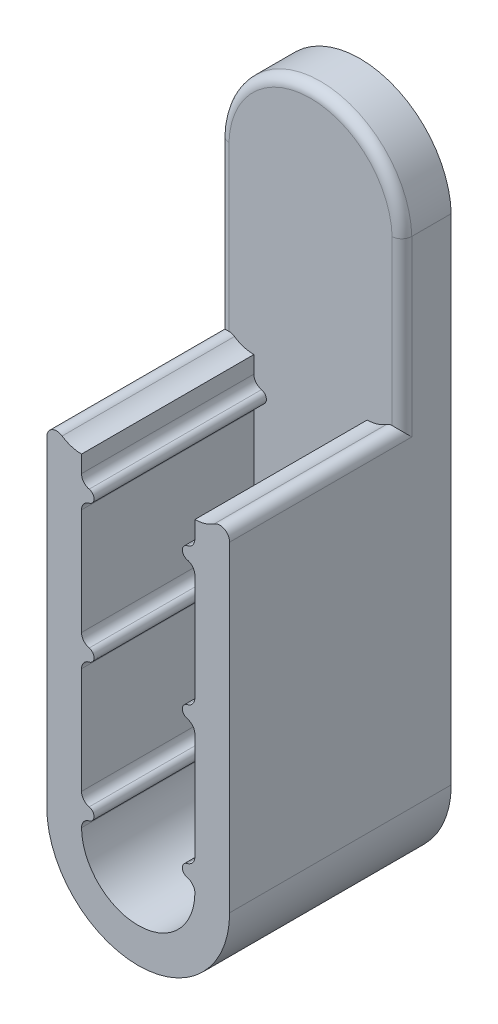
ISO-10303-21;
HEADER;
FILE_DESCRIPTION(('STEP AP214'),'2;1');
FILE_NAME('part.step','',(''),(''),'','','');
FILE_SCHEMA(('AUTOMOTIVE_DESIGN { 1 0 10303 214 1 1 1 1 }'));
ENDSEC;
DATA;
#1=APPLICATION_CONTEXT('core data for automotive mechanical design processes');
#2=APPLICATION_PROTOCOL_DEFINITION('international standard','automotive_design',2000,#1);
#3=PRODUCT_CONTEXT('',#1,'mechanical');
#4=PRODUCT('Part','Part','',(#3));
#5=PRODUCT_RELATED_PRODUCT_CATEGORY('part','',(#4));
#6=PRODUCT_DEFINITION_FORMATION('','',#4);
#7=PRODUCT_DEFINITION_CONTEXT('part definition',#1,'design');
#8=PRODUCT_DEFINITION('design','',#6,#7);
#9=PRODUCT_DEFINITION_SHAPE('','',#8);
#10=(LENGTH_UNIT() NAMED_UNIT(*) SI_UNIT(.MILLI.,.METRE.));
#11=(NAMED_UNIT(*) PLANE_ANGLE_UNIT() SI_UNIT($,.RADIAN.));
#12=(NAMED_UNIT(*) SI_UNIT($,.STERADIAN.) SOLID_ANGLE_UNIT());
#13=UNCERTAINTY_MEASURE_WITH_UNIT(LENGTH_MEASURE(1.E-05),#10,'distance_accuracy_value','');
#14=(GEOMETRIC_REPRESENTATION_CONTEXT(3) GLOBAL_UNCERTAINTY_ASSIGNED_CONTEXT((#13)) GLOBAL_UNIT_ASSIGNED_CONTEXT((#10,
#11,#12)) REPRESENTATION_CONTEXT('',''));
#15=CARTESIAN_POINT('',(0.,0.,0.));
#16=DIRECTION('',(0.,0.,1.));
#17=DIRECTION('',(1.,0.,0.));
#18=AXIS2_PLACEMENT_3D('',#15,#16,#17);
#19=CARTESIAN_POINT('',(-190.164800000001,-88.0783372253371,-17.4882111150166));
#20=DIRECTION('',(0.,0.,-1.));
#21=DIRECTION('',(0.,-1.,0.));
#22=AXIS2_PLACEMENT_3D('',#19,#20,#21);
#23=CYLINDRICAL_SURFACE('',#22,5.);
#24=CARTESIAN_POINT('',(-190.164800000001,-88.0783372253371,-22.4882111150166));
#25=DIRECTION('',(0.,0.,-1.));
#26=DIRECTION('',(-1.,0.,0.));
#27=AXIS2_PLACEMENT_3D('',#24,#25,#26);
#28=CIRCLE('',#27,5.);
#29=CARTESIAN_POINT('',(-195.164800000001,-88.0783372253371,-22.4882111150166));
#30=VERTEX_POINT('',#29);
#31=EDGE_CURVE('E10',#30,#30,#28,.T.);
#32=ORIENTED_EDGE('',*,*,#31,.T.);
#33=EDGE_LOOP('',(#32));
#34=FACE_BOUND('',#33,.T.);
#35=CARTESIAN_POINT('',(-190.164800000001,-88.0783372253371,-17.4882111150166));
#36=DIRECTION('',(0.,0.,-1.));
#37=DIRECTION('',(-1.,0.,0.));
#38=AXIS2_PLACEMENT_3D('',#35,#36,#37);
#39=CIRCLE('',#38,5.);
#40=CARTESIAN_POINT('',(-195.164800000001,-88.0783372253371,-17.4882111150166));
#41=VERTEX_POINT('',#40);
#42=EDGE_CURVE('E296',#41,#41,#39,.T.);
#43=ORIENTED_EDGE('',*,*,#42,.F.);
#44=EDGE_LOOP('',(#43));
#45=FACE_BOUND('',#44,.T.);
#46=ADVANCED_FACE('F16',(#34,#45),#23,.F.);
#47=CARTESIAN_POINT('',(-190.164800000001,12.3771834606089,-17.4882111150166));
#48=DIRECTION('',(0.,0.,-1.));
#49=DIRECTION('',(0.,-1.,0.));
#50=AXIS2_PLACEMENT_3D('',#47,#48,#49);
#51=CYLINDRICAL_SURFACE('',#50,5.);
#52=CARTESIAN_POINT('',(-190.164800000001,12.3771834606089,-22.4882111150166));
#53=DIRECTION('',(0.,0.,-1.));
#54=DIRECTION('',(-1.,0.,0.));
#55=AXIS2_PLACEMENT_3D('',#52,#53,#54);
#56=CIRCLE('',#55,5.);
#57=CARTESIAN_POINT('',(-195.164800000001,12.3771834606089,-22.4882111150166));
#58=VERTEX_POINT('',#57);
#59=EDGE_CURVE('E33',#58,#58,#56,.T.);
#60=ORIENTED_EDGE('',*,*,#59,.T.);
#61=EDGE_LOOP('',(#60));
#62=FACE_BOUND('',#61,.T.);
#63=CARTESIAN_POINT('',(-190.164800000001,12.3771834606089,-17.4882111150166));
#64=DIRECTION('',(0.,0.,-1.));
#65=DIRECTION('',(-1.,0.,0.));
#66=AXIS2_PLACEMENT_3D('',#63,#64,#65);
#67=CIRCLE('',#66,5.);
#68=CARTESIAN_POINT('',(-195.164800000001,12.3771834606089,-17.4882111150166));
#69=VERTEX_POINT('',#68);
#70=EDGE_CURVE('E293',#69,#69,#67,.T.);
#71=ORIENTED_EDGE('',*,*,#70,.F.);
#72=EDGE_LOOP('',(#71));
#73=FACE_BOUND('',#72,.T.);
#74=ADVANCED_FACE('F325',(#62,#73),#51,.F.);
#75=CARTESIAN_POINT('',(-180.655607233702,-88.1372084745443,151.477692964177));
#76=DIRECTION('',(0.,0.,1.));
#77=DIRECTION('',(1.,0.,0.));
#78=AXIS2_PLACEMENT_3D('',#75,#76,#77);
#79=CYLINDRICAL_SURFACE('',#78,2.);
#80=CARTESIAN_POINT('',(-180.655607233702,-88.1372084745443,-12.4882111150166));
#81=DIRECTION('',(0.,0.,-1.));
#82=DIRECTION('',(-1.,0.,0.));
#83=AXIS2_PLACEMENT_3D('',#80,#81,#82);
#84=CIRCLE('',#83,2.);
#85=CARTESIAN_POINT('',(-180.209012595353,-86.1877077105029,-12.4882111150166));
#86=VERTEX_POINT('',#85);
#87=CARTESIAN_POINT('',(-178.655645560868,-88.1495902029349,-12.4882111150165));
#88=VERTEX_POINT('',#87);
#89=EDGE_CURVE('E548',#86,#88,#84,.T.);
#90=ORIENTED_EDGE('',*,*,#89,.T.);
#91=DIRECTION('',(0.,0.,1.));
#92=VECTOR('',#91,1.);
#93=CARTESIAN_POINT('',(-178.655645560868,-88.1495902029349,-12.4882111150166));
#94=LINE('',#93,#92);
#95=CARTESIAN_POINT('',(-178.655645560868,-88.1495902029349,22.5117888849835));
#96=VERTEX_POINT('',#95);
#97=EDGE_CURVE('E42',#88,#96,#94,.T.);
#98=ORIENTED_EDGE('',*,*,#97,.T.);
#99=CARTESIAN_POINT('',(-180.655607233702,-88.1372084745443,22.5117888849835));
#100=DIRECTION('',(0.,0.,-1.));
#101=DIRECTION('',(-1.,0.,0.));
#102=AXIS2_PLACEMENT_3D('',#99,#100,#101);
#103=CIRCLE('',#102,2.);
#104=CARTESIAN_POINT('',(-180.209012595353,-86.1877077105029,22.5117888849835));
#105=VERTEX_POINT('',#104);
#106=EDGE_CURVE('E589',#105,#96,#103,.T.);
#107=ORIENTED_EDGE('',*,*,#106,.F.);
#108=DIRECTION('',(0.,0.,-1.));
#109=VECTOR('',#108,1.);
#110=CARTESIAN_POINT('',(-180.209012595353,-86.1877077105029,22.5117888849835));
#111=LINE('',#110,#109);
#112=EDGE_CURVE('E553',#105,#86,#111,.T.);
#113=ORIENTED_EDGE('',*,*,#112,.T.);
#114=EDGE_LOOP('',(#90,#98,#107,#113));
#115=FACE_BOUND('',#114,.T.);
#116=ADVANCED_FACE('F327',(#115),#79,.F.);
#117=CARTESIAN_POINT('',(-200.404175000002,-29.0697747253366,125.863752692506));
#118=DIRECTION('',(0.,0.,1.));
#119=DIRECTION('',(1.,0.,0.));
#120=AXIS2_PLACEMENT_3D('',#117,#118,#119);
#121=CYLINDRICAL_SURFACE('',#120,1.26999999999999);
#122=CARTESIAN_POINT('',(-200.404175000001,-29.0697747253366,-12.4882111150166));
#123=DIRECTION('',(0.,0.,-1.));
#124=DIRECTION('',(-1.,0.,0.));
#125=AXIS2_PLACEMENT_3D('',#122,#123,#124);
#126=CIRCLE('',#125,1.26999999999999);
#127=CARTESIAN_POINT('',(-200.120658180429,-30.3077239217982,-12.4882111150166));
#128=VERTEX_POINT('',#127);
#129=CARTESIAN_POINT('',(-200.120658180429,-27.831825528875,-12.4882111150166));
#130=VERTEX_POINT('',#129);
#131=EDGE_CURVE('E550',#128,#130,#126,.F.);
#132=ORIENTED_EDGE('',*,*,#131,.T.);
#133=DIRECTION('',(0.,0.,-1.));
#134=VECTOR('',#133,1.);
#135=CARTESIAN_POINT('',(-200.120658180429,-27.831825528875,22.5117888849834));
#136=LINE('',#135,#134);
#137=CARTESIAN_POINT('',(-200.120658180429,-27.831825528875,22.5117888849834));
#138=VERTEX_POINT('',#137);
#139=EDGE_CURVE('E507',#138,#130,#136,.T.);
#140=ORIENTED_EDGE('',*,*,#139,.F.);
#141=CARTESIAN_POINT('',(-200.404175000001,-29.0697747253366,22.5117888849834));
#142=DIRECTION('',(0.,0.,-1.));
#143=DIRECTION('',(-1.,0.,0.));
#144=AXIS2_PLACEMENT_3D('',#141,#142,#143);
#145=CIRCLE('',#144,1.26999999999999);
#146=CARTESIAN_POINT('',(-200.120658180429,-30.3077239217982,22.5117888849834));
#147=VERTEX_POINT('',#146);
#148=EDGE_CURVE('E554',#138,#147,#145,.T.);
#149=ORIENTED_EDGE('',*,*,#148,.T.);
#150=DIRECTION('',(0.,0.,1.));
#151=VECTOR('',#150,1.);
#152=CARTESIAN_POINT('',(-200.120658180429,-30.3077239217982,-12.4882111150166));
#153=LINE('',#152,#151);
#154=EDGE_CURVE('E510',#128,#147,#153,.T.);
#155=ORIENTED_EDGE('',*,*,#154,.F.);
#156=EDGE_LOOP('',(#132,#140,#149,#155));
#157=FACE_BOUND('',#156,.T.);
#158=ADVANCED_FACE('F330',(#157),#121,.T.);
#159=CARTESIAN_POINT('',(-179.925425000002,-84.9497747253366,125.863752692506));
#160=DIRECTION('',(0.,0.,-1.));
#161=DIRECTION('',(0.,-1.,0.));
#162=AXIS2_PLACEMENT_3D('',#159,#160,#161);
#163=CYLINDRICAL_SURFACE('',#162,1.26999999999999);
#164=CARTESIAN_POINT('',(-179.925425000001,-84.9497747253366,22.5117888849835));
#165=DIRECTION('',(0.,0.,-1.));
#166=DIRECTION('',(-1.,0.,0.));
#167=AXIS2_PLACEMENT_3D('',#164,#165,#166);
#168=CIRCLE('',#167,1.26999999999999);
#169=CARTESIAN_POINT('',(-180.208941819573,-83.711825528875,22.5117888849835));
#170=VERTEX_POINT('',#169);
#171=EDGE_CURVE('E557',#105,#170,#168,.T.);
#172=ORIENTED_EDGE('',*,*,#171,.T.);
#173=DIRECTION('',(0.,0.,1.));
#174=VECTOR('',#173,1.);
#175=CARTESIAN_POINT('',(-180.208941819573,-83.711825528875,-12.4882111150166));
#176=LINE('',#175,#174);
#177=CARTESIAN_POINT('',(-180.208941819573,-83.711825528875,-12.4882111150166));
#178=VERTEX_POINT('',#177);
#179=EDGE_CURVE('E489',#178,#170,#176,.T.);
#180=ORIENTED_EDGE('',*,*,#179,.F.);
#181=CARTESIAN_POINT('',(-179.925425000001,-84.9497747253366,-12.4882111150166));
#182=DIRECTION('',(0.,0.,-1.));
#183=DIRECTION('',(-1.,0.,0.));
#184=AXIS2_PLACEMENT_3D('',#181,#182,#183);
#185=CIRCLE('',#184,1.26999999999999);
#186=EDGE_CURVE('E560',#178,#86,#185,.F.);
#187=ORIENTED_EDGE('',*,*,#186,.T.);
#188=ORIENTED_EDGE('',*,*,#112,.F.);
#189=EDGE_LOOP('',(#172,#180,#187,#188));
#190=FACE_BOUND('',#189,.T.);
#191=ADVANCED_FACE('F339',(#190),#163,.T.);
#192=CARTESIAN_POINT('',(-179.925425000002,-29.0697747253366,125.863752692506));
#193=DIRECTION('',(0.,0.,-1.));
#194=DIRECTION('',(0.,-1.,0.));
#195=AXIS2_PLACEMENT_3D('',#192,#193,#194);
#196=CYLINDRICAL_SURFACE('',#195,1.26999999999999);
#197=CARTESIAN_POINT('',(-179.925425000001,-29.0697747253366,22.5117888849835));
#198=DIRECTION('',(0.,0.,-1.));
#199=DIRECTION('',(-1.,0.,0.));
#200=AXIS2_PLACEMENT_3D('',#197,#198,#199);
#201=CIRCLE('',#200,1.26999999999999);
#202=CARTESIAN_POINT('',(-180.208941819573,-30.3077239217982,22.5117888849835));
#203=VERTEX_POINT('',#202);
#204=CARTESIAN_POINT('',(-180.208941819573,-27.831825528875,22.5117888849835));
#205=VERTEX_POINT('',#204);
#206=EDGE_CURVE('E563',#203,#205,#201,.T.);
#207=ORIENTED_EDGE('',*,*,#206,.T.);
#208=DIRECTION('',(0.,0.,1.));
#209=VECTOR('',#208,1.);
#210=CARTESIAN_POINT('',(-180.208941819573,-27.831825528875,-12.4882111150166));
#211=LINE('',#210,#209);
#212=CARTESIAN_POINT('',(-180.208941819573,-27.831825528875,-12.4882111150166));
#213=VERTEX_POINT('',#212);
#214=EDGE_CURVE('E537',#213,#205,#211,.T.);
#215=ORIENTED_EDGE('',*,*,#214,.F.);
#216=CARTESIAN_POINT('',(-179.925425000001,-29.0697747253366,-12.4882111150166));
#217=DIRECTION('',(0.,0.,-1.));
#218=DIRECTION('',(-1.,0.,0.));
#219=AXIS2_PLACEMENT_3D('',#216,#217,#218);
#220=CIRCLE('',#219,1.26999999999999);
#221=CARTESIAN_POINT('',(-180.208941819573,-30.3077239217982,-12.4882111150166));
#222=VERTEX_POINT('',#221);
#223=EDGE_CURVE('E541',#213,#222,#220,.F.);
#224=ORIENTED_EDGE('',*,*,#223,.T.);
#225=DIRECTION('',(0.,0.,-1.));
#226=VECTOR('',#225,1.);
#227=CARTESIAN_POINT('',(-180.208941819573,-30.3077239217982,22.5117888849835));
#228=LINE('',#227,#226);
#229=EDGE_CURVE('E486',#203,#222,#228,.T.);
#230=ORIENTED_EDGE('',*,*,#229,.F.);
#231=EDGE_LOOP('',(#207,#215,#224,#230));
#232=FACE_BOUND('',#231,.T.);
#233=ADVANCED_FACE('F335',(#232),#196,.T.);
#234=CARTESIAN_POINT('',(-171.598195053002,-3.26421222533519,-22.4882111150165));
#235=DIRECTION('',(-1.,0.,0.));
#236=DIRECTION('',(0.,0.,1.));
#237=AXIS2_PLACEMENT_3D('',#234,#235,#236);
#238=PLANE('',#237);
#239=DIRECTION('',(0.,0.,-1.));
#240=VECTOR('',#239,1.);
#241=CARTESIAN_POINT('',(-171.598195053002,12.3771834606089,-14.4882111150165));
#242=LINE('',#241,#240);
#243=CARTESIAN_POINT('',(-171.598195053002,12.3771834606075,-14.4882111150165));
#244=VERTEX_POINT('',#243);
#245=CARTESIAN_POINT('',(-171.598195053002,12.3771834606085,-22.4882111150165));
#246=VERTEX_POINT('',#245);
#247=EDGE_CURVE('E266',#244,#246,#242,.T.);
#248=ORIENTED_EDGE('',*,*,#247,.F.);
#249=DIRECTION('',(0.,-1.,0.));
#250=VECTOR('',#249,1.);
#251=CARTESIAN_POINT('',(-171.598195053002,12.377183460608,-14.4882111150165));
#252=LINE('',#251,#250);
#253=CARTESIAN_POINT('',(-171.598195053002,-22.8978254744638,-14.4882111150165));
#254=VERTEX_POINT('',#253);
#255=EDGE_CURVE('E539',#244,#254,#252,.T.);
#256=ORIENTED_EDGE('',*,*,#255,.T.);
#257=DIRECTION('',(0.,0.,1.));
#258=VECTOR('',#257,1.);
#259=CARTESIAN_POINT('',(-171.598195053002,-22.8978254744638,-14.4882111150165));
#260=LINE('',#259,#258);
#261=CARTESIAN_POINT('',(-171.598195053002,-22.8978254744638,22.5117888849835));
#262=VERTEX_POINT('',#261);
#263=EDGE_CURVE('E542',#254,#262,#260,.T.);
#264=ORIENTED_EDGE('',*,*,#263,.T.);
#265=DIRECTION('',(0.,-1.,0.));
#266=VECTOR('',#265,1.);
#267=CARTESIAN_POINT('',(-171.598195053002,-3.26421222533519,22.5117888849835));
#268=LINE('',#267,#266);
#269=CARTESIAN_POINT('',(-171.598195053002,-88.0783372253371,22.5117888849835));
#270=VERTEX_POINT('',#269);
#271=EDGE_CURVE('E456',#262,#270,#268,.T.);
#272=ORIENTED_EDGE('',*,*,#271,.T.);
#273=DIRECTION('',(0.,0.,1.));
#274=VECTOR('',#273,1.);
#275=CARTESIAN_POINT('',(-171.598195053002,-88.0783372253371,-22.4882111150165));
#276=LINE('',#275,#274);
#277=CARTESIAN_POINT('',(-171.598195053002,-88.0783372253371,-22.4882111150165));
#278=VERTEX_POINT('',#277);
#279=EDGE_CURVE('E532',#278,#270,#276,.T.);
#280=ORIENTED_EDGE('',*,*,#279,.F.);
#281=DIRECTION('',(0.,1.,0.));
#282=VECTOR('',#281,1.);
#283=CARTESIAN_POINT('',(-171.598195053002,0.,-22.4882111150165));
#284=LINE('',#283,#282);
#285=EDGE_CURVE('E569',#246,#278,#284,.F.);
#286=ORIENTED_EDGE('',*,*,#285,.F.);
#287=EDGE_LOOP('',(#248,#256,#264,#272,#280,#286));
#288=FACE_BOUND('',#287,.T.);
#289=ADVANCED_FACE('F338',(#288),#238,.F.);
#290=CARTESIAN_POINT('',(-190.153011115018,0.,-22.4882111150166));
#291=DIRECTION('',(0.,0.,-1.));
#292=DIRECTION('',(-1.,0.,0.));
#293=AXIS2_PLACEMENT_3D('',#290,#291,#292);
#294=PLANE('',#293);
#295=ORIENTED_EDGE('',*,*,#285,.T.);
#296=CARTESIAN_POINT('',(-190.164800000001,-88.0783372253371,-22.4882111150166));
#297=DIRECTION('',(0.,0.,-1.));
#298=DIRECTION('',(-1.,0.,0.));
#299=AXIS2_PLACEMENT_3D('',#296,#297,#298);
#300=CIRCLE('',#299,18.5666049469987);
#301=CARTESIAN_POINT('',(-208.731404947,-88.0783372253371,-22.4882111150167));
#302=VERTEX_POINT('',#301);
#303=EDGE_CURVE('E303',#302,#278,#300,.F.);
#304=ORIENTED_EDGE('',*,*,#303,.F.);
#305=DIRECTION('',(0.,-1.,0.));
#306=VECTOR('',#305,1.);
#307=CARTESIAN_POINT('',(-208.731404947,0.,-22.4882111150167));
#308=LINE('',#307,#306);
#309=CARTESIAN_POINT('',(-208.731404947,12.3771834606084,-22.4882111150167));
#310=VERTEX_POINT('',#309);
#311=EDGE_CURVE('E572',#302,#310,#308,.F.);
#312=ORIENTED_EDGE('',*,*,#311,.T.);
#313=CARTESIAN_POINT('',(-190.164800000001,11.8187877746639,-22.4882111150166));
#314=DIRECTION('',(0.,0.,-1.));
#315=DIRECTION('',(-1.,0.,0.));
#316=AXIS2_PLACEMENT_3D('',#313,#314,#315);
#317=CIRCLE('',#316,18.575);
#318=EDGE_CURVE('E273',#310,#246,#317,.T.);
#319=ORIENTED_EDGE('',*,*,#318,.T.);
#320=EDGE_LOOP('',(#295,#304,#312,#319));
#321=FACE_BOUND('',#320,.T.);
#322=ORIENTED_EDGE('',*,*,#31,.F.);
#323=EDGE_LOOP('',(#322));
#324=FACE_BOUND('',#323,.T.);
#325=ORIENTED_EDGE('',*,*,#59,.F.);
#326=EDGE_LOOP('',(#325));
#327=FACE_BOUND('',#326,.T.);
#328=ADVANCED_FACE('F705',(#321,#324,#327),#294,.T.);
#329=CARTESIAN_POINT('',(-190.153011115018,0.,22.5117888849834));
#330=DIRECTION('',(0.,0.,-1.));
#331=DIRECTION('',(-1.,0.,0.));
#332=AXIS2_PLACEMENT_3D('',#329,#330,#331);
#333=PLANE('',#332);
#334=ORIENTED_EDGE('',*,*,#271,.F.);
#335=CARTESIAN_POINT('',(-173.598195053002,-22.8978254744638,22.5117888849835));
#336=DIRECTION('',(0.,0.,-1.));
#337=DIRECTION('',(-1.,0.,0.));
#338=AXIS2_PLACEMENT_3D('',#335,#336,#337);
#339=CIRCLE('',#338,2.);
#340=CARTESIAN_POINT('',(-174.714922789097,-21.2386331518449,22.5117888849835));
#341=VERTEX_POINT('',#340);
#342=EDGE_CURVE('E449',#262,#341,#339,.F.);
#343=ORIENTED_EDGE('',*,*,#342,.T.);
#344=CARTESIAN_POINT('',(-178.655425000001,-15.3839822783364,22.5117888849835));
#345=DIRECTION('',(0.,0.,-1.));
#346=DIRECTION('',(-1.,0.,0.));
#347=AXIS2_PLACEMENT_3D('',#344,#345,#346);
#348=CIRCLE('',#347,7.05722994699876);
#349=CARTESIAN_POINT('',(-178.655425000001,-22.4412122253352,22.5117888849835));
#350=VERTEX_POINT('',#349);
#351=EDGE_CURVE('E441',#341,#350,#348,.T.);
#352=ORIENTED_EDGE('',*,*,#351,.T.);
#353=DIRECTION('',(0.,-1.,0.));
#354=VECTOR('',#353,1.);
#355=CARTESIAN_POINT('',(-178.655425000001,-9.62691222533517,22.5117888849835));
#356=LINE('',#355,#354);
#357=CARTESIAN_POINT('',(-178.655425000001,-25.8822992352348,22.5117888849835));
#358=VERTEX_POINT('',#357);
#359=EDGE_CURVE('E466',#358,#350,#356,.F.);
#360=ORIENTED_EDGE('',*,*,#359,.F.);
#361=CARTESIAN_POINT('',(-180.655425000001,-25.8822992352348,22.5117888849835));
#362=DIRECTION('',(0.,0.,-1.));
#363=DIRECTION('',(-1.,0.,0.));
#364=AXIS2_PLACEMENT_3D('',#361,#362,#363);
#365=CIRCLE('',#364,2.);
#366=EDGE_CURVE('E450',#358,#205,#365,.T.);
#367=ORIENTED_EDGE('',*,*,#366,.T.);
#368=ORIENTED_EDGE('',*,*,#206,.F.);
#369=CARTESIAN_POINT('',(-180.655425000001,-32.2572502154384,22.5117888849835));
#370=DIRECTION('',(0.,0.,-1.));
#371=DIRECTION('',(-1.,0.,0.));
#372=AXIS2_PLACEMENT_3D('',#369,#370,#371);
#373=CIRCLE('',#372,2.);
#374=CARTESIAN_POINT('',(-178.655425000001,-32.2572502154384,22.5117888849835));
#375=VERTEX_POINT('',#374);
#376=EDGE_CURVE('E577',#203,#375,#373,.T.);
#377=ORIENTED_EDGE('',*,*,#376,.T.);
#378=DIRECTION('',(0.,-1.,0.));
#379=VECTOR('',#378,1.);
#380=CARTESIAN_POINT('',(-178.655425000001,-9.62691222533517,22.5117888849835));
#381=LINE('',#380,#379);
#382=CARTESIAN_POINT('',(-178.655425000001,-53.8222992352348,22.5117888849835));
#383=VERTEX_POINT('',#382);
#384=EDGE_CURVE('E668',#383,#375,#381,.F.);
#385=ORIENTED_EDGE('',*,*,#384,.F.);
#386=CARTESIAN_POINT('',(-180.655425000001,-53.8222992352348,22.5117888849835));
#387=DIRECTION('',(0.,0.,-1.));
#388=DIRECTION('',(-1.,0.,0.));
#389=AXIS2_PLACEMENT_3D('',#386,#387,#388);
#390=CIRCLE('',#389,2.);
#391=CARTESIAN_POINT('',(-180.208941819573,-55.771825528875,22.5117888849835));
#392=VERTEX_POINT('',#391);
#393=EDGE_CURVE('E580',#383,#392,#390,.T.);
#394=ORIENTED_EDGE('',*,*,#393,.T.);
#395=CARTESIAN_POINT('',(-179.925425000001,-57.0097747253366,22.5117888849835));
#396=DIRECTION('',(0.,0.,-1.));
#397=DIRECTION('',(-1.,0.,0.));
#398=AXIS2_PLACEMENT_3D('',#395,#396,#397);
#399=CIRCLE('',#398,1.26999999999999);
#400=CARTESIAN_POINT('',(-180.208941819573,-58.2477239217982,22.5117888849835));
#401=VERTEX_POINT('',#400);
#402=EDGE_CURVE('E642',#401,#392,#399,.T.);
#403=ORIENTED_EDGE('',*,*,#402,.F.);
#404=CARTESIAN_POINT('',(-180.655425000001,-60.1972502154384,22.5117888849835));
#405=DIRECTION('',(0.,0.,-1.));
#406=DIRECTION('',(-1.,0.,0.));
#407=AXIS2_PLACEMENT_3D('',#404,#405,#406);
#408=CIRCLE('',#407,2.);
#409=CARTESIAN_POINT('',(-178.655425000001,-60.1972502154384,22.5117888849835));
#410=VERTEX_POINT('',#409);
#411=EDGE_CURVE('E583',#401,#410,#408,.T.);
#412=ORIENTED_EDGE('',*,*,#411,.T.);
#413=DIRECTION('',(0.,-1.,0.));
#414=VECTOR('',#413,1.);
#415=CARTESIAN_POINT('',(-178.655425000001,-9.62691222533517,22.5117888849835));
#416=LINE('',#415,#414);
#417=CARTESIAN_POINT('',(-178.655425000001,-81.7622992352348,22.5117888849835));
#418=VERTEX_POINT('',#417);
#419=EDGE_CURVE('E663',#418,#410,#416,.F.);
#420=ORIENTED_EDGE('',*,*,#419,.F.);
#421=CARTESIAN_POINT('',(-180.655425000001,-81.7622992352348,22.5117888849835));
#422=DIRECTION('',(0.,0.,-1.));
#423=DIRECTION('',(-1.,0.,0.));
#424=AXIS2_PLACEMENT_3D('',#421,#422,#423);
#425=CIRCLE('',#424,2.);
#426=EDGE_CURVE('E586',#418,#170,#425,.T.);
#427=ORIENTED_EDGE('',*,*,#426,.T.);
#428=ORIENTED_EDGE('',*,*,#171,.F.);
#429=ORIENTED_EDGE('',*,*,#106,.T.);
#430=CARTESIAN_POINT('',(-190.164800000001,-88.0783372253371,22.5117888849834));
#431=DIRECTION('',(0.,0.,-1.));
#432=DIRECTION('',(-1.,0.,0.));
#433=AXIS2_PLACEMENT_3D('',#430,#431,#432);
#434=CIRCLE('',#433,11.509375);
#435=CARTESIAN_POINT('',(-201.673954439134,-88.1495902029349,22.5117888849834));
#436=VERTEX_POINT('',#435);
#437=EDGE_CURVE('E591',#96,#436,#434,.T.);
#438=ORIENTED_EDGE('',*,*,#437,.T.);
#439=CARTESIAN_POINT('',(-199.673992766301,-88.1372084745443,22.5117888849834));
#440=DIRECTION('',(0.,0.,-1.));
#441=DIRECTION('',(-1.,0.,0.));
#442=AXIS2_PLACEMENT_3D('',#439,#440,#441);
#443=CIRCLE('',#442,2.);
#444=CARTESIAN_POINT('',(-200.12058740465,-86.1877077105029,22.5117888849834));
#445=VERTEX_POINT('',#444);
#446=EDGE_CURVE('E594',#436,#445,#443,.T.);
#447=ORIENTED_EDGE('',*,*,#446,.T.);
#448=CARTESIAN_POINT('',(-200.404175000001,-84.9497747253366,22.5117888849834));
#449=DIRECTION('',(0.,0.,-1.));
#450=DIRECTION('',(-1.,0.,0.));
#451=AXIS2_PLACEMENT_3D('',#448,#449,#450);
#452=CIRCLE('',#451,1.26999999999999);
#453=CARTESIAN_POINT('',(-200.120658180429,-83.711825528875,22.5117888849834));
#454=VERTEX_POINT('',#453);
#455=EDGE_CURVE('E647',#454,#445,#452,.T.);
#456=ORIENTED_EDGE('',*,*,#455,.F.);
#457=CARTESIAN_POINT('',(-199.674175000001,-81.7622992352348,22.5117888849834));
#458=DIRECTION('',(0.,0.,-1.));
#459=DIRECTION('',(-1.,0.,0.));
#460=AXIS2_PLACEMENT_3D('',#457,#458,#459);
#461=CIRCLE('',#460,2.);
#462=CARTESIAN_POINT('',(-201.674175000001,-81.7622992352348,22.5117888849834));
#463=VERTEX_POINT('',#462);
#464=EDGE_CURVE('E597',#454,#463,#461,.T.);
#465=ORIENTED_EDGE('',*,*,#464,.T.);
#466=DIRECTION('',(0.,1.,0.));
#467=VECTOR('',#466,1.);
#468=CARTESIAN_POINT('',(-201.674175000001,0.,22.5117888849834));
#469=LINE('',#468,#467);
#470=CARTESIAN_POINT('',(-201.674175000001,-60.1972502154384,22.5117888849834));
#471=VERTEX_POINT('',#470);
#472=EDGE_CURVE('E600',#463,#471,#469,.T.);
#473=ORIENTED_EDGE('',*,*,#472,.T.);
#474=CARTESIAN_POINT('',(-199.674175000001,-60.1972502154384,22.5117888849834));
#475=DIRECTION('',(0.,0.,-1.));
#476=DIRECTION('',(-1.,0.,0.));
#477=AXIS2_PLACEMENT_3D('',#474,#475,#476);
#478=CIRCLE('',#477,2.);
#479=CARTESIAN_POINT('',(-200.120658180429,-58.2477239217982,22.5117888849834));
#480=VERTEX_POINT('',#479);
#481=EDGE_CURVE('E603',#471,#480,#478,.T.);
#482=ORIENTED_EDGE('',*,*,#481,.T.);
#483=CARTESIAN_POINT('',(-200.404175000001,-57.0097747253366,22.5117888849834));
#484=DIRECTION('',(0.,0.,-1.));
#485=DIRECTION('',(-1.,0.,0.));
#486=AXIS2_PLACEMENT_3D('',#483,#484,#485);
#487=CIRCLE('',#486,1.26999999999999);
#488=CARTESIAN_POINT('',(-200.120658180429,-55.771825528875,22.5117888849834));
#489=VERTEX_POINT('',#488);
#490=EDGE_CURVE('E652',#489,#480,#487,.T.);
#491=ORIENTED_EDGE('',*,*,#490,.F.);
#492=CARTESIAN_POINT('',(-199.674175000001,-53.8222992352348,22.5117888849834));
#493=DIRECTION('',(0.,0.,-1.));
#494=DIRECTION('',(-1.,0.,0.));
#495=AXIS2_PLACEMENT_3D('',#492,#493,#494);
#496=CIRCLE('',#495,2.);
#497=CARTESIAN_POINT('',(-201.674175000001,-53.8222992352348,22.5117888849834));
#498=VERTEX_POINT('',#497);
#499=EDGE_CURVE('E606',#489,#498,#496,.T.);
#500=ORIENTED_EDGE('',*,*,#499,.T.);
#501=DIRECTION('',(0.,1.,0.));
#502=VECTOR('',#501,1.);
#503=CARTESIAN_POINT('',(-201.674175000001,0.,22.5117888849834));
#504=LINE('',#503,#502);
#505=CARTESIAN_POINT('',(-201.674175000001,-32.2572502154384,22.5117888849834));
#506=VERTEX_POINT('',#505);
#507=EDGE_CURVE('E609',#498,#506,#504,.T.);
#508=ORIENTED_EDGE('',*,*,#507,.T.);
#509=CARTESIAN_POINT('',(-199.674175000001,-32.2572502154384,22.5117888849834));
#510=DIRECTION('',(0.,0.,-1.));
#511=DIRECTION('',(-1.,0.,0.));
#512=AXIS2_PLACEMENT_3D('',#509,#510,#511);
#513=CIRCLE('',#512,2.);
#514=EDGE_CURVE('E612',#506,#147,#513,.T.);
#515=ORIENTED_EDGE('',*,*,#514,.T.);
#516=ORIENTED_EDGE('',*,*,#148,.F.);
#517=CARTESIAN_POINT('',(-199.674175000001,-25.8822992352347,22.5117888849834));
#518=DIRECTION('',(0.,0.,-1.));
#519=DIRECTION('',(-1.,0.,0.));
#520=AXIS2_PLACEMENT_3D('',#517,#518,#519);
#521=CIRCLE('',#520,2.);
#522=CARTESIAN_POINT('',(-201.674175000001,-25.8822992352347,22.5117888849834));
#523=VERTEX_POINT('',#522);
#524=EDGE_CURVE('E615',#138,#523,#521,.T.);
#525=ORIENTED_EDGE('',*,*,#524,.T.);
#526=DIRECTION('',(0.,1.,0.));
#527=VECTOR('',#526,1.);
#528=CARTESIAN_POINT('',(-201.674175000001,0.,22.5117888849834));
#529=LINE('',#528,#527);
#530=CARTESIAN_POINT('',(-201.674175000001,-22.4412122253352,22.5117888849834));
#531=VERTEX_POINT('',#530);
#532=EDGE_CURVE('E618',#523,#531,#529,.T.);
#533=ORIENTED_EDGE('',*,*,#532,.T.);
#534=CARTESIAN_POINT('',(-201.674175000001,-15.3839822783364,22.5117888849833));
#535=DIRECTION('',(0.,0.,-1.));
#536=DIRECTION('',(-1.,0.,0.));
#537=AXIS2_PLACEMENT_3D('',#534,#535,#536);
#538=CIRCLE('',#537,7.05722994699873);
#539=CARTESIAN_POINT('',(-205.614677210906,-21.2386331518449,22.5117888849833));
#540=VERTEX_POINT('',#539);
#541=EDGE_CURVE('E621',#531,#540,#538,.T.);
#542=ORIENTED_EDGE('',*,*,#541,.T.);
#543=CARTESIAN_POINT('',(-206.731404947,-22.8978254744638,22.5117888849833));
#544=DIRECTION('',(0.,0.,-1.));
#545=DIRECTION('',(-1.,0.,0.));
#546=AXIS2_PLACEMENT_3D('',#543,#544,#545);
#547=CIRCLE('',#546,2.);
#548=CARTESIAN_POINT('',(-208.731404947,-22.8978254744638,22.5117888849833));
#549=VERTEX_POINT('',#548);
#550=EDGE_CURVE('E624',#540,#549,#547,.F.);
#551=ORIENTED_EDGE('',*,*,#550,.T.);
#552=DIRECTION('',(0.,1.,0.));
#553=VECTOR('',#552,1.);
#554=CARTESIAN_POINT('',(-208.731404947,-3.26421222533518,22.5117888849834));
#555=LINE('',#554,#553);
#556=CARTESIAN_POINT('',(-208.731404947,-88.0783372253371,22.5117888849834));
#557=VERTEX_POINT('',#556);
#558=EDGE_CURVE('E629',#557,#549,#555,.T.);
#559=ORIENTED_EDGE('',*,*,#558,.F.);
#560=CARTESIAN_POINT('',(-190.164800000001,-88.0783372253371,22.5117888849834));
#561=DIRECTION('',(0.,0.,-1.));
#562=DIRECTION('',(-1.,0.,0.));
#563=AXIS2_PLACEMENT_3D('',#560,#561,#562);
#564=CIRCLE('',#563,18.5666049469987);
#565=EDGE_CURVE('E627',#557,#270,#564,.F.);
#566=ORIENTED_EDGE('',*,*,#565,.T.);
#567=EDGE_LOOP('',(#334,#343,#352,#360,#367,#368,#377,#385,#394,#403,#412,#420,#427,#428,#429,
#438,#447,#456,#465,#473,#482,#491,#500,#508,#515,#516,#525,#533,#542,#551,#559,#566));
#568=FACE_BOUND('',#567,.T.);
#569=ADVANCED_FACE('F453',(#568),#333,.F.);
#570=CARTESIAN_POINT('',(-208.731404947,-3.26421222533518,-22.4882111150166));
#571=DIRECTION('',(1.,0.,0.));
#572=DIRECTION('',(0.,0.,-1.));
#573=AXIS2_PLACEMENT_3D('',#570,#571,#572);
#574=PLANE('',#573);
#575=DIRECTION('',(0.,0.,-1.));
#576=VECTOR('',#575,1.);
#577=CARTESIAN_POINT('',(-208.731404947,-22.8978254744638,22.5117888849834));
#578=LINE('',#577,#576);
#579=CARTESIAN_POINT('',(-208.731404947,-22.8978254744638,-14.4882111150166));
#580=VERTEX_POINT('',#579);
#581=EDGE_CURVE('E283',#549,#580,#578,.T.);
#582=ORIENTED_EDGE('',*,*,#581,.T.);
#583=DIRECTION('',(0.,1.,0.));
#584=VECTOR('',#583,1.);
#585=CARTESIAN_POINT('',(-208.731404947,-22.8978254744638,-14.4882111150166));
#586=LINE('',#585,#584);
#587=CARTESIAN_POINT('',(-208.731404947,12.3771834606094,-14.4882111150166));
#588=VERTEX_POINT('',#587);
#589=EDGE_CURVE('E277',#580,#588,#586,.T.);
#590=ORIENTED_EDGE('',*,*,#589,.T.);
#591=DIRECTION('',(0.,0.,-1.));
#592=VECTOR('',#591,1.);
#593=CARTESIAN_POINT('',(-208.731404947,12.3771834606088,-14.4882111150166));
#594=LINE('',#593,#592);
#595=EDGE_CURVE('E269',#588,#310,#594,.T.);
#596=ORIENTED_EDGE('',*,*,#595,.T.);
#597=ORIENTED_EDGE('',*,*,#311,.F.);
#598=DIRECTION('',(0.,0.,1.));
#599=VECTOR('',#598,1.);
#600=CARTESIAN_POINT('',(-208.731404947,-88.0783372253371,-22.4882111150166));
#601=LINE('',#600,#599);
#602=EDGE_CURVE('E278',#302,#557,#601,.T.);
#603=ORIENTED_EDGE('',*,*,#602,.T.);
#604=ORIENTED_EDGE('',*,*,#558,.T.);
#605=EDGE_LOOP('',(#582,#590,#596,#597,#603,#604));
#606=FACE_BOUND('',#605,.T.);
#607=ADVANCED_FACE('F281',(#606),#574,.F.);
#608=CARTESIAN_POINT('',(-201.674175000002,-9.62691222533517,362.261588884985));
#609=DIRECTION('',(-1.,0.,0.));
#610=DIRECTION('',(0.,0.,1.));
#611=AXIS2_PLACEMENT_3D('',#608,#609,#610);
#612=PLANE('',#611);
#613=DIRECTION('',(0.,0.,1.));
#614=VECTOR('',#613,1.);
#615=CARTESIAN_POINT('',(-201.674175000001,-25.8822992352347,-12.4882111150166));
#616=LINE('',#615,#614);
#617=CARTESIAN_POINT('',(-201.674175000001,-25.8822992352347,-12.4882111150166));
#618=VERTEX_POINT('',#617);
#619=EDGE_CURVE('E517',#618,#523,#616,.T.);
#620=ORIENTED_EDGE('',*,*,#619,.F.);
#621=DIRECTION('',(0.,-1.,0.));
#622=VECTOR('',#621,1.);
#623=CARTESIAN_POINT('',(-201.674175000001,-9.62691222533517,-12.4882111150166));
#624=LINE('',#623,#622);
#625=CARTESIAN_POINT('',(-201.674175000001,-22.4412122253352,-12.4882111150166));
#626=VERTEX_POINT('',#625);
#627=EDGE_CURVE('E631',#618,#626,#624,.F.);
#628=ORIENTED_EDGE('',*,*,#627,.T.);
#629=DIRECTION('',(0.,0.,-1.));
#630=VECTOR('',#629,1.);
#631=CARTESIAN_POINT('',(-201.674175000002,-22.4412122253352,340.757265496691));
#632=LINE('',#631,#630);
#633=EDGE_CURVE('E634',#626,#531,#632,.F.);
#634=ORIENTED_EDGE('',*,*,#633,.T.);
#635=ORIENTED_EDGE('',*,*,#532,.F.);
#636=EDGE_LOOP('',(#620,#628,#634,#635));
#637=FACE_BOUND('',#636,.T.);
#638=ADVANCED_FACE('F435',(#637),#612,.F.);
#639=CARTESIAN_POINT('',(-178.655425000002,-9.62691222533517,362.261588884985));
#640=DIRECTION('',(-1.,0.,0.));
#641=DIRECTION('',(0.,0.,1.));
#642=AXIS2_PLACEMENT_3D('',#639,#640,#641);
#643=PLANE('',#642);
#644=ORIENTED_EDGE('',*,*,#359,.T.);
#645=DIRECTION('',(0.,0.,-1.));
#646=VECTOR('',#645,1.);
#647=CARTESIAN_POINT('',(-178.655425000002,-22.4412122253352,340.757265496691));
#648=LINE('',#647,#646);
#649=CARTESIAN_POINT('',(-178.655425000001,-22.4412122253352,-12.4882111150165));
#650=VERTEX_POINT('',#649);
#651=EDGE_CURVE('E447',#650,#350,#648,.F.);
#652=ORIENTED_EDGE('',*,*,#651,.F.);
#653=DIRECTION('',(0.,-1.,0.));
#654=VECTOR('',#653,1.);
#655=CARTESIAN_POINT('',(-178.655425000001,-9.62691222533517,-12.4882111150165));
#656=LINE('',#655,#654);
#657=CARTESIAN_POINT('',(-178.655425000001,-25.8822992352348,-12.4882111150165));
#658=VERTEX_POINT('',#657);
#659=EDGE_CURVE('E462',#650,#658,#656,.T.);
#660=ORIENTED_EDGE('',*,*,#659,.T.);
#661=DIRECTION('',(0.,0.,-1.));
#662=VECTOR('',#661,1.);
#663=CARTESIAN_POINT('',(-178.655425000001,-25.8822992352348,22.5117888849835));
#664=LINE('',#663,#662);
#665=EDGE_CURVE('E471',#358,#658,#664,.T.);
#666=ORIENTED_EDGE('',*,*,#665,.F.);
#667=EDGE_LOOP('',(#644,#652,#660,#666));
#668=FACE_BOUND('',#667,.T.);
#669=ADVANCED_FACE('F429',(#668),#643,.T.);
#670=CARTESIAN_POINT('',(-178.655425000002,-15.3839822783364,340.757265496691));
#671=DIRECTION('',(0.,0.,-1.));
#672=DIRECTION('',(0.,-1.,0.));
#673=AXIS2_PLACEMENT_3D('',#670,#671,#672);
#674=CYLINDRICAL_SURFACE('',#673,7.05722994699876);
#675=ORIENTED_EDGE('',*,*,#351,.F.);
#676=DIRECTION('',(0.,0.,-1.));
#677=VECTOR('',#676,1.);
#678=CARTESIAN_POINT('',(-174.714922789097,-21.2386331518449,22.5117888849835));
#679=LINE('',#678,#677);
#680=CARTESIAN_POINT('',(-174.714922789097,-21.2386331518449,-12.4882111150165));
#681=VERTEX_POINT('',#680);
#682=EDGE_CURVE('E445',#341,#681,#679,.T.);
#683=ORIENTED_EDGE('',*,*,#682,.T.);
#684=CARTESIAN_POINT('',(-178.655425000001,-15.3839822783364,-12.4882111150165));
#685=DIRECTION('',(0.,0.,-1.));
#686=DIRECTION('',(-1.,0.,0.));
#687=AXIS2_PLACEMENT_3D('',#684,#685,#686);
#688=CIRCLE('',#687,7.05722994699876);
#689=EDGE_CURVE('E463',#681,#650,#688,.T.);
#690=ORIENTED_EDGE('',*,*,#689,.T.);
#691=ORIENTED_EDGE('',*,*,#651,.T.);
#692=EDGE_LOOP('',(#675,#683,#690,#691));
#693=FACE_BOUND('',#692,.T.);
#694=ADVANCED_FACE('F354',(#693),#674,.F.);
#695=CARTESIAN_POINT('',(-201.674175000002,-15.3839822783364,340.757265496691));
#696=DIRECTION('',(0.,0.,-1.));
#697=DIRECTION('',(0.,-1.,0.));
#698=AXIS2_PLACEMENT_3D('',#695,#696,#697);
#699=CYLINDRICAL_SURFACE('',#698,7.05722994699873);
#700=CARTESIAN_POINT('',(-201.674175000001,-15.3839822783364,-12.4882111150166));
#701=DIRECTION('',(0.,0.,-1.));
#702=DIRECTION('',(-1.,0.,0.));
#703=AXIS2_PLACEMENT_3D('',#700,#701,#702);
#704=CIRCLE('',#703,7.05722994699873);
#705=CARTESIAN_POINT('',(-205.614677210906,-21.2386331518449,-12.4882111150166));
#706=VERTEX_POINT('',#705);
#707=EDGE_CURVE('E476',#626,#706,#704,.T.);
#708=ORIENTED_EDGE('',*,*,#707,.T.);
#709=DIRECTION('',(0.,0.,1.));
#710=VECTOR('',#709,1.);
#711=CARTESIAN_POINT('',(-205.614677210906,-21.2386331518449,-12.4882111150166));
#712=LINE('',#711,#710);
#713=EDGE_CURVE('E473',#706,#540,#712,.T.);
#714=ORIENTED_EDGE('',*,*,#713,.T.);
#715=ORIENTED_EDGE('',*,*,#541,.F.);
#716=ORIENTED_EDGE('',*,*,#633,.F.);
#717=EDGE_LOOP('',(#708,#714,#715,#716));
#718=FACE_BOUND('',#717,.T.);
#719=ADVANCED_FACE('F351',(#718),#699,.F.);
#720=CARTESIAN_POINT('',(-190.164800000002,-88.0783372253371,151.477692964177));
#721=DIRECTION('',(0.,0.,1.));
#722=DIRECTION('',(1.,0.,0.));
#723=AXIS2_PLACEMENT_3D('',#720,#721,#722);
#724=CYLINDRICAL_SURFACE('',#723,11.509375);
#725=ORIENTED_EDGE('',*,*,#97,.F.);
#726=CARTESIAN_POINT('',(-190.164800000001,-88.0783372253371,-12.4882111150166));
#727=DIRECTION('',(0.,0.,-1.));
#728=DIRECTION('',(-1.,0.,0.));
#729=AXIS2_PLACEMENT_3D('',#726,#727,#728);
#730=CIRCLE('',#729,11.509375);
#731=CARTESIAN_POINT('',(-201.673954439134,-88.1495902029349,-12.4882111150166));
#732=VERTEX_POINT('',#731);
#733=EDGE_CURVE('E477',#88,#732,#730,.T.);
#734=ORIENTED_EDGE('',*,*,#733,.T.);
#735=DIRECTION('',(0.,0.,-1.));
#736=VECTOR('',#735,1.);
#737=CARTESIAN_POINT('',(-201.673954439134,-88.1495902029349,22.5117888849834));
#738=LINE('',#737,#736);
#739=EDGE_CURVE('E478',#436,#732,#738,.T.);
#740=ORIENTED_EDGE('',*,*,#739,.F.);
#741=ORIENTED_EDGE('',*,*,#437,.F.);
#742=EDGE_LOOP('',(#725,#734,#740,#741));
#743=FACE_BOUND('',#742,.T.);
#744=ADVANCED_FACE('F347',(#743),#724,.F.);
#745=CARTESIAN_POINT('',(-179.925425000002,-57.0097747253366,125.863752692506));
#746=DIRECTION('',(0.,0.,1.));
#747=DIRECTION('',(1.,0.,0.));
#748=AXIS2_PLACEMENT_3D('',#745,#746,#747);
#749=CYLINDRICAL_SURFACE('',#748,1.26999999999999);
#750=ORIENTED_EDGE('',*,*,#402,.T.);
#751=DIRECTION('',(0.,0.,1.));
#752=VECTOR('',#751,1.);
#753=CARTESIAN_POINT('',(-180.208941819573,-55.771825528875,-12.4882111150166));
#754=LINE('',#753,#752);
#755=CARTESIAN_POINT('',(-180.208941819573,-55.771825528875,-12.4882111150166));
#756=VERTEX_POINT('',#755);
#757=EDGE_CURVE('E482',#756,#392,#754,.T.);
#758=ORIENTED_EDGE('',*,*,#757,.F.);
#759=CARTESIAN_POINT('',(-179.925425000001,-57.0097747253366,-12.4882111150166));
#760=DIRECTION('',(0.,0.,-1.));
#761=DIRECTION('',(-1.,0.,0.));
#762=AXIS2_PLACEMENT_3D('',#759,#760,#761);
#763=CIRCLE('',#762,1.26999999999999);
#764=CARTESIAN_POINT('',(-180.208941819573,-58.2477239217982,-12.4882111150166));
#765=VERTEX_POINT('',#764);
#766=EDGE_CURVE('E644',#756,#765,#763,.F.);
#767=ORIENTED_EDGE('',*,*,#766,.T.);
#768=DIRECTION('',(0.,0.,-1.));
#769=VECTOR('',#768,1.);
#770=CARTESIAN_POINT('',(-180.208941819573,-58.2477239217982,22.5117888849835));
#771=LINE('',#770,#769);
#772=EDGE_CURVE('E487',#401,#765,#771,.T.);
#773=ORIENTED_EDGE('',*,*,#772,.F.);
#774=EDGE_LOOP('',(#750,#758,#767,#773));
#775=FACE_BOUND('',#774,.T.);
#776=ADVANCED_FACE('F350',(#775),#749,.T.);
#777=CARTESIAN_POINT('',(-200.404175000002,-84.9497747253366,125.863752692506));
#778=DIRECTION('',(0.,0.,-1.));
#779=DIRECTION('',(0.,-1.,0.));
#780=AXIS2_PLACEMENT_3D('',#777,#778,#779);
#781=CYLINDRICAL_SURFACE('',#780,1.26999999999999);
#782=ORIENTED_EDGE('',*,*,#455,.T.);
#783=DIRECTION('',(0.,0.,1.));
#784=VECTOR('',#783,1.);
#785=CARTESIAN_POINT('',(-200.12058740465,-86.1877077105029,-12.4882111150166));
#786=LINE('',#785,#784);
#787=CARTESIAN_POINT('',(-200.12058740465,-86.1877077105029,-12.4882111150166));
#788=VERTEX_POINT('',#787);
#789=EDGE_CURVE('E491',#788,#445,#786,.T.);
#790=ORIENTED_EDGE('',*,*,#789,.F.);
#791=CARTESIAN_POINT('',(-200.404175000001,-84.9497747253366,-12.4882111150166));
#792=DIRECTION('',(0.,0.,-1.));
#793=DIRECTION('',(-1.,0.,0.));
#794=AXIS2_PLACEMENT_3D('',#791,#792,#793);
#795=CIRCLE('',#794,1.26999999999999);
#796=CARTESIAN_POINT('',(-200.120658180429,-83.711825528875,-12.4882111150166));
#797=VERTEX_POINT('',#796);
#798=EDGE_CURVE('E649',#788,#797,#795,.F.);
#799=ORIENTED_EDGE('',*,*,#798,.T.);
#800=DIRECTION('',(0.,0.,-1.));
#801=VECTOR('',#800,1.);
#802=CARTESIAN_POINT('',(-200.120658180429,-83.711825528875,22.5117888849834));
#803=LINE('',#802,#801);
#804=EDGE_CURVE('E494',#454,#797,#803,.T.);
#805=ORIENTED_EDGE('',*,*,#804,.F.);
#806=EDGE_LOOP('',(#782,#790,#799,#805));
#807=FACE_BOUND('',#806,.T.);
#808=ADVANCED_FACE('F358',(#807),#781,.T.);
#809=CARTESIAN_POINT('',(-200.404175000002,-57.0097747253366,125.863752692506));
#810=DIRECTION('',(0.,0.,-1.));
#811=DIRECTION('',(0.,-1.,0.));
#812=AXIS2_PLACEMENT_3D('',#809,#810,#811);
#813=CYLINDRICAL_SURFACE('',#812,1.26999999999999);
#814=ORIENTED_EDGE('',*,*,#490,.T.);
#815=DIRECTION('',(0.,0.,1.));
#816=VECTOR('',#815,1.);
#817=CARTESIAN_POINT('',(-200.120658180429,-58.2477239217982,-12.4882111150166));
#818=LINE('',#817,#816);
#819=CARTESIAN_POINT('',(-200.120658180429,-58.2477239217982,-12.4882111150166));
#820=VERTEX_POINT('',#819);
#821=EDGE_CURVE('E497',#820,#480,#818,.T.);
#822=ORIENTED_EDGE('',*,*,#821,.F.);
#823=CARTESIAN_POINT('',(-200.404175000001,-57.0097747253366,-12.4882111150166));
#824=DIRECTION('',(0.,0.,-1.));
#825=DIRECTION('',(-1.,0.,0.));
#826=AXIS2_PLACEMENT_3D('',#823,#824,#825);
#827=CIRCLE('',#826,1.26999999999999);
#828=CARTESIAN_POINT('',(-200.120658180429,-55.771825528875,-12.4882111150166));
#829=VERTEX_POINT('',#828);
#830=EDGE_CURVE('E654',#820,#829,#827,.F.);
#831=ORIENTED_EDGE('',*,*,#830,.T.);
#832=DIRECTION('',(0.,0.,-1.));
#833=VECTOR('',#832,1.);
#834=CARTESIAN_POINT('',(-200.120658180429,-55.771825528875,22.5117888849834));
#835=LINE('',#834,#833);
#836=EDGE_CURVE('E501',#489,#829,#835,.T.);
#837=ORIENTED_EDGE('',*,*,#836,.F.);
#838=EDGE_LOOP('',(#814,#822,#831,#837));
#839=FACE_BOUND('',#838,.T.);
#840=ADVANCED_FACE('F362',(#839),#813,.T.);
#841=CARTESIAN_POINT('',(-201.674175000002,-9.62691222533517,362.261588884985));
#842=DIRECTION('',(-1.,0.,0.));
#843=DIRECTION('',(0.,0.,1.));
#844=AXIS2_PLACEMENT_3D('',#841,#842,#843);
#845=PLANE('',#844);
#846=DIRECTION('',(0.,0.,1.));
#847=VECTOR('',#846,1.);
#848=CARTESIAN_POINT('',(-201.674175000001,-81.7622992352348,-12.4882111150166));
#849=LINE('',#848,#847);
#850=CARTESIAN_POINT('',(-201.674175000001,-81.7622992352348,-12.4882111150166));
#851=VERTEX_POINT('',#850);
#852=EDGE_CURVE('E504',#851,#463,#849,.T.);
#853=ORIENTED_EDGE('',*,*,#852,.F.);
#854=DIRECTION('',(0.,-1.,0.));
#855=VECTOR('',#854,1.);
#856=CARTESIAN_POINT('',(-201.674175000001,-9.62691222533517,-12.4882111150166));
#857=LINE('',#856,#855);
#858=CARTESIAN_POINT('',(-201.674175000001,-60.1972502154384,-12.4882111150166));
#859=VERTEX_POINT('',#858);
#860=EDGE_CURVE('E657',#851,#859,#857,.F.);
#861=ORIENTED_EDGE('',*,*,#860,.T.);
#862=DIRECTION('',(0.,0.,-1.));
#863=VECTOR('',#862,1.);
#864=CARTESIAN_POINT('',(-201.674175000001,-60.1972502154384,22.5117888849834));
#865=LINE('',#864,#863);
#866=EDGE_CURVE('E508',#471,#859,#865,.T.);
#867=ORIENTED_EDGE('',*,*,#866,.F.);
#868=ORIENTED_EDGE('',*,*,#472,.F.);
#869=EDGE_LOOP('',(#853,#861,#867,#868));
#870=FACE_BOUND('',#869,.T.);
#871=ADVANCED_FACE('F366',(#870),#845,.F.);
#872=CARTESIAN_POINT('',(-201.674175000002,-9.62691222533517,362.261588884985));
#873=DIRECTION('',(-1.,0.,0.));
#874=DIRECTION('',(0.,0.,1.));
#875=AXIS2_PLACEMENT_3D('',#872,#873,#874);
#876=PLANE('',#875);
#877=DIRECTION('',(0.,0.,1.));
#878=VECTOR('',#877,1.);
#879=CARTESIAN_POINT('',(-201.674175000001,-53.8222992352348,-12.4882111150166));
#880=LINE('',#879,#878);
#881=CARTESIAN_POINT('',(-201.674175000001,-53.8222992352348,-12.4882111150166));
#882=VERTEX_POINT('',#881);
#883=EDGE_CURVE('E511',#882,#498,#880,.T.);
#884=ORIENTED_EDGE('',*,*,#883,.F.);
#885=DIRECTION('',(0.,-1.,0.));
#886=VECTOR('',#885,1.);
#887=CARTESIAN_POINT('',(-201.674175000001,-9.62691222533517,-12.4882111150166));
#888=LINE('',#887,#886);
#889=CARTESIAN_POINT('',(-201.674175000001,-32.2572502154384,-12.4882111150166));
#890=VERTEX_POINT('',#889);
#891=EDGE_CURVE('E660',#882,#890,#888,.F.);
#892=ORIENTED_EDGE('',*,*,#891,.T.);
#893=DIRECTION('',(0.,0.,-1.));
#894=VECTOR('',#893,1.);
#895=CARTESIAN_POINT('',(-201.674175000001,-32.2572502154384,22.5117888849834));
#896=LINE('',#895,#894);
#897=EDGE_CURVE('E515',#506,#890,#896,.T.);
#898=ORIENTED_EDGE('',*,*,#897,.F.);
#899=ORIENTED_EDGE('',*,*,#507,.F.);
#900=EDGE_LOOP('',(#884,#892,#898,#899));
#901=FACE_BOUND('',#900,.T.);
#902=ADVANCED_FACE('F774',(#901),#876,.F.);
#903=CARTESIAN_POINT('',(-178.655425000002,-9.62691222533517,362.261588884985));
#904=DIRECTION('',(-1.,0.,0.));
#905=DIRECTION('',(0.,0.,1.));
#906=AXIS2_PLACEMENT_3D('',#903,#904,#905);
#907=PLANE('',#906);
#908=ORIENTED_EDGE('',*,*,#419,.T.);
#909=DIRECTION('',(0.,0.,1.));
#910=VECTOR('',#909,1.);
#911=CARTESIAN_POINT('',(-178.655425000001,-60.1972502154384,-12.4882111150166));
#912=LINE('',#911,#910);
#913=CARTESIAN_POINT('',(-178.655425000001,-60.1972502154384,-12.4882111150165));
#914=VERTEX_POINT('',#913);
#915=EDGE_CURVE('E519',#914,#410,#912,.T.);
#916=ORIENTED_EDGE('',*,*,#915,.F.);
#917=DIRECTION('',(0.,-1.,0.));
#918=VECTOR('',#917,1.);
#919=CARTESIAN_POINT('',(-178.655425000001,-9.62691222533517,-12.4882111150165));
#920=LINE('',#919,#918);
#921=CARTESIAN_POINT('',(-178.655425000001,-81.7622992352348,-12.4882111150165));
#922=VERTEX_POINT('',#921);
#923=EDGE_CURVE('E665',#914,#922,#920,.T.);
#924=ORIENTED_EDGE('',*,*,#923,.T.);
#925=DIRECTION('',(0.,0.,-1.));
#926=VECTOR('',#925,1.);
#927=CARTESIAN_POINT('',(-178.655425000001,-81.7622992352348,22.5117888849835));
#928=LINE('',#927,#926);
#929=EDGE_CURVE('E514',#418,#922,#928,.T.);
#930=ORIENTED_EDGE('',*,*,#929,.F.);
#931=EDGE_LOOP('',(#908,#916,#924,#930));
#932=FACE_BOUND('',#931,.T.);
#933=ADVANCED_FACE('F751',(#932),#907,.T.);
#934=CARTESIAN_POINT('',(-178.655425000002,-9.62691222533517,362.261588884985));
#935=DIRECTION('',(-1.,0.,0.));
#936=DIRECTION('',(0.,0.,1.));
#937=AXIS2_PLACEMENT_3D('',#934,#935,#936);
#938=PLANE('',#937);
#939=ORIENTED_EDGE('',*,*,#384,.T.);
#940=DIRECTION('',(0.,0.,1.));
#941=VECTOR('',#940,1.);
#942=CARTESIAN_POINT('',(-178.655425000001,-32.2572502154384,-12.4882111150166));
#943=LINE('',#942,#941);
#944=CARTESIAN_POINT('',(-178.655425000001,-32.2572502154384,-12.4882111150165));
#945=VERTEX_POINT('',#944);
#946=EDGE_CURVE('E525',#945,#375,#943,.T.);
#947=ORIENTED_EDGE('',*,*,#946,.F.);
#948=DIRECTION('',(0.,-1.,0.));
#949=VECTOR('',#948,1.);
#950=CARTESIAN_POINT('',(-178.655425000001,-9.62691222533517,-12.4882111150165));
#951=LINE('',#950,#949);
#952=CARTESIAN_POINT('',(-178.655425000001,-53.8222992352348,-12.4882111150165));
#953=VERTEX_POINT('',#952);
#954=EDGE_CURVE('E480',#945,#953,#951,.T.);
#955=ORIENTED_EDGE('',*,*,#954,.T.);
#956=DIRECTION('',(0.,0.,-1.));
#957=VECTOR('',#956,1.);
#958=CARTESIAN_POINT('',(-178.655425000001,-53.8222992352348,22.5117888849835));
#959=LINE('',#958,#957);
#960=EDGE_CURVE('E522',#383,#953,#959,.T.);
#961=ORIENTED_EDGE('',*,*,#960,.F.);
#962=EDGE_LOOP('',(#939,#947,#955,#961));
#963=FACE_BOUND('',#962,.T.);
#964=ADVANCED_FACE('F372',(#963),#938,.T.);
#965=CARTESIAN_POINT('',(-199.673992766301,-88.1372084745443,125.863752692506));
#966=DIRECTION('',(0.,0.,1.));
#967=DIRECTION('',(1.,0.,0.));
#968=AXIS2_PLACEMENT_3D('',#965,#966,#967);
#969=CYLINDRICAL_SURFACE('',#968,2.);
#970=ORIENTED_EDGE('',*,*,#739,.T.);
#971=CARTESIAN_POINT('',(-199.673992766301,-88.1372084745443,-12.4882111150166));
#972=DIRECTION('',(0.,0.,-1.));
#973=DIRECTION('',(-1.,0.,0.));
#974=AXIS2_PLACEMENT_3D('',#971,#972,#973);
#975=CIRCLE('',#974,2.);
#976=EDGE_CURVE('E481',#732,#788,#975,.T.);
#977=ORIENTED_EDGE('',*,*,#976,.T.);
#978=ORIENTED_EDGE('',*,*,#789,.T.);
#979=ORIENTED_EDGE('',*,*,#446,.F.);
#980=EDGE_LOOP('',(#970,#977,#978,#979));
#981=FACE_BOUND('',#980,.T.);
#982=ADVANCED_FACE('F368',(#981),#969,.F.);
#983=CARTESIAN_POINT('',(-199.674175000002,-81.7622992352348,125.863752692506));
#984=DIRECTION('',(0.,0.,-1.));
#985=DIRECTION('',(0.,-1.,0.));
#986=AXIS2_PLACEMENT_3D('',#983,#984,#985);
#987=CYLINDRICAL_SURFACE('',#986,2.);
#988=ORIENTED_EDGE('',*,*,#804,.T.);
#989=CARTESIAN_POINT('',(-199.674175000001,-81.7622992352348,-12.4882111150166));
#990=DIRECTION('',(0.,0.,-1.));
#991=DIRECTION('',(-1.,0.,0.));
#992=AXIS2_PLACEMENT_3D('',#989,#990,#991);
#993=CIRCLE('',#992,2.);
#994=EDGE_CURVE('E496',#797,#851,#993,.T.);
#995=ORIENTED_EDGE('',*,*,#994,.T.);
#996=ORIENTED_EDGE('',*,*,#852,.T.);
#997=ORIENTED_EDGE('',*,*,#464,.F.);
#998=EDGE_LOOP('',(#988,#995,#996,#997));
#999=FACE_BOUND('',#998,.T.);
#1000=ADVANCED_FACE('F371',(#999),#987,.F.);
#1001=CARTESIAN_POINT('',(-199.674175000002,-25.8822992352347,125.863752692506));
#1002=DIRECTION('',(0.,0.,1.));
#1003=DIRECTION('',(1.,0.,0.));
#1004=AXIS2_PLACEMENT_3D('',#1001,#1002,#1003);
#1005=CYLINDRICAL_SURFACE('',#1004,2.);
#1006=ORIENTED_EDGE('',*,*,#139,.T.);
#1007=CARTESIAN_POINT('',(-199.674175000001,-25.8822992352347,-12.4882111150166));
#1008=DIRECTION('',(0.,0.,-1.));
#1009=DIRECTION('',(-1.,0.,0.));
#1010=AXIS2_PLACEMENT_3D('',#1007,#1008,#1009);
#1011=CIRCLE('',#1010,2.);
#1012=EDGE_CURVE('E676',#130,#618,#1011,.T.);
#1013=ORIENTED_EDGE('',*,*,#1012,.T.);
#1014=ORIENTED_EDGE('',*,*,#619,.T.);
#1015=ORIENTED_EDGE('',*,*,#524,.F.);
#1016=EDGE_LOOP('',(#1006,#1013,#1014,#1015));
#1017=FACE_BOUND('',#1016,.T.);
#1018=ADVANCED_FACE('F378',(#1017),#1005,.F.);
#1019=CARTESIAN_POINT('',(-199.674175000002,-32.2572502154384,125.863752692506));
#1020=DIRECTION('',(0.,0.,1.));
#1021=DIRECTION('',(1.,0.,0.));
#1022=AXIS2_PLACEMENT_3D('',#1019,#1020,#1021);
#1023=CYLINDRICAL_SURFACE('',#1022,2.);
#1024=ORIENTED_EDGE('',*,*,#897,.T.);
#1025=CARTESIAN_POINT('',(-199.674175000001,-32.2572502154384,-12.4882111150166));
#1026=DIRECTION('',(0.,0.,-1.));
#1027=DIRECTION('',(-1.,0.,0.));
#1028=AXIS2_PLACEMENT_3D('',#1025,#1026,#1027);
#1029=CIRCLE('',#1028,2.);
#1030=EDGE_CURVE('E518',#890,#128,#1029,.T.);
#1031=ORIENTED_EDGE('',*,*,#1030,.T.);
#1032=ORIENTED_EDGE('',*,*,#154,.T.);
#1033=ORIENTED_EDGE('',*,*,#514,.F.);
#1034=EDGE_LOOP('',(#1024,#1031,#1032,#1033));
#1035=FACE_BOUND('',#1034,.T.);
#1036=ADVANCED_FACE('F374',(#1035),#1023,.F.);
#1037=CARTESIAN_POINT('',(-199.674175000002,-60.1972502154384,125.863752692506));
#1038=DIRECTION('',(0.,0.,-1.));
#1039=DIRECTION('',(0.,-1.,0.));
#1040=AXIS2_PLACEMENT_3D('',#1037,#1038,#1039);
#1041=CYLINDRICAL_SURFACE('',#1040,2.);
#1042=ORIENTED_EDGE('',*,*,#866,.T.);
#1043=CARTESIAN_POINT('',(-199.674175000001,-60.1972502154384,-12.4882111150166));
#1044=DIRECTION('',(0.,0.,-1.));
#1045=DIRECTION('',(-1.,0.,0.));
#1046=AXIS2_PLACEMENT_3D('',#1043,#1044,#1045);
#1047=CIRCLE('',#1046,2.);
#1048=EDGE_CURVE('E500',#859,#820,#1047,.T.);
#1049=ORIENTED_EDGE('',*,*,#1048,.T.);
#1050=ORIENTED_EDGE('',*,*,#821,.T.);
#1051=ORIENTED_EDGE('',*,*,#481,.F.);
#1052=EDGE_LOOP('',(#1042,#1049,#1050,#1051));
#1053=FACE_BOUND('',#1052,.T.);
#1054=ADVANCED_FACE('F377',(#1053),#1041,.F.);
#1055=CARTESIAN_POINT('',(-199.674175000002,-53.8222992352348,125.863752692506));
#1056=DIRECTION('',(0.,0.,-1.));
#1057=DIRECTION('',(0.,-1.,0.));
#1058=AXIS2_PLACEMENT_3D('',#1055,#1056,#1057);
#1059=CYLINDRICAL_SURFACE('',#1058,2.);
#1060=ORIENTED_EDGE('',*,*,#836,.T.);
#1061=CARTESIAN_POINT('',(-199.674175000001,-53.8222992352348,-12.4882111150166));
#1062=DIRECTION('',(0.,0.,-1.));
#1063=DIRECTION('',(-1.,0.,0.));
#1064=AXIS2_PLACEMENT_3D('',#1061,#1062,#1063);
#1065=CIRCLE('',#1064,2.);
#1066=EDGE_CURVE('E503',#829,#882,#1065,.T.);
#1067=ORIENTED_EDGE('',*,*,#1066,.T.);
#1068=ORIENTED_EDGE('',*,*,#883,.T.);
#1069=ORIENTED_EDGE('',*,*,#499,.F.);
#1070=EDGE_LOOP('',(#1060,#1067,#1068,#1069));
#1071=FACE_BOUND('',#1070,.T.);
#1072=ADVANCED_FACE('F388',(#1071),#1059,.F.);
#1073=CARTESIAN_POINT('',(-180.655425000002,-81.7622992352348,125.863752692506));
#1074=DIRECTION('',(0.,0.,-1.));
#1075=DIRECTION('',(0.,-1.,0.));
#1076=AXIS2_PLACEMENT_3D('',#1073,#1074,#1075);
#1077=CYLINDRICAL_SURFACE('',#1076,2.);
#1078=ORIENTED_EDGE('',*,*,#929,.T.);
#1079=CARTESIAN_POINT('',(-180.655425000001,-81.7622992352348,-12.4882111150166));
#1080=DIRECTION('',(0.,0.,-1.));
#1081=DIRECTION('',(-1.,0.,0.));
#1082=AXIS2_PLACEMENT_3D('',#1079,#1080,#1081);
#1083=CIRCLE('',#1082,2.);
#1084=EDGE_CURVE('E524',#922,#178,#1083,.T.);
#1085=ORIENTED_EDGE('',*,*,#1084,.T.);
#1086=ORIENTED_EDGE('',*,*,#179,.T.);
#1087=ORIENTED_EDGE('',*,*,#426,.F.);
#1088=EDGE_LOOP('',(#1078,#1085,#1086,#1087));
#1089=FACE_BOUND('',#1088,.T.);
#1090=ADVANCED_FACE('F392',(#1089),#1077,.F.);
#1091=CARTESIAN_POINT('',(-180.655425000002,-60.1972502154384,125.863752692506));
#1092=DIRECTION('',(0.,0.,1.));
#1093=DIRECTION('',(1.,0.,0.));
#1094=AXIS2_PLACEMENT_3D('',#1091,#1092,#1093);
#1095=CYLINDRICAL_SURFACE('',#1094,2.);
#1096=ORIENTED_EDGE('',*,*,#772,.T.);
#1097=CARTESIAN_POINT('',(-180.655425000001,-60.1972502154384,-12.4882111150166));
#1098=DIRECTION('',(0.,0.,-1.));
#1099=DIRECTION('',(-1.,0.,0.));
#1100=AXIS2_PLACEMENT_3D('',#1097,#1098,#1099);
#1101=CIRCLE('',#1100,2.);
#1102=EDGE_CURVE('E490',#765,#914,#1101,.T.);
#1103=ORIENTED_EDGE('',*,*,#1102,.T.);
#1104=ORIENTED_EDGE('',*,*,#915,.T.);
#1105=ORIENTED_EDGE('',*,*,#411,.F.);
#1106=EDGE_LOOP('',(#1096,#1103,#1104,#1105));
#1107=FACE_BOUND('',#1106,.T.);
#1108=ADVANCED_FACE('F396',(#1107),#1095,.F.);
#1109=CARTESIAN_POINT('',(-180.655425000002,-53.8222992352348,125.863752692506));
#1110=DIRECTION('',(0.,0.,1.));
#1111=DIRECTION('',(1.,0.,0.));
#1112=AXIS2_PLACEMENT_3D('',#1109,#1110,#1111);
#1113=CYLINDRICAL_SURFACE('',#1112,2.);
#1114=ORIENTED_EDGE('',*,*,#960,.T.);
#1115=CARTESIAN_POINT('',(-180.655425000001,-53.8222992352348,-12.4882111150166));
#1116=DIRECTION('',(0.,0.,-1.));
#1117=DIRECTION('',(-1.,0.,0.));
#1118=AXIS2_PLACEMENT_3D('',#1115,#1116,#1117);
#1119=CIRCLE('',#1118,2.);
#1120=EDGE_CURVE('E485',#953,#756,#1119,.T.);
#1121=ORIENTED_EDGE('',*,*,#1120,.T.);
#1122=ORIENTED_EDGE('',*,*,#757,.T.);
#1123=ORIENTED_EDGE('',*,*,#393,.F.);
#1124=EDGE_LOOP('',(#1114,#1121,#1122,#1123));
#1125=FACE_BOUND('',#1124,.T.);
#1126=ADVANCED_FACE('F410',(#1125),#1113,.F.);
#1127=CARTESIAN_POINT('',(-180.655425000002,-32.2572502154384,125.863752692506));
#1128=DIRECTION('',(0.,0.,-1.));
#1129=DIRECTION('',(0.,-1.,0.));
#1130=AXIS2_PLACEMENT_3D('',#1127,#1128,#1129);
#1131=CYLINDRICAL_SURFACE('',#1130,2.);
#1132=ORIENTED_EDGE('',*,*,#229,.T.);
#1133=CARTESIAN_POINT('',(-180.655425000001,-32.2572502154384,-12.4882111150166));
#1134=DIRECTION('',(0.,0.,-1.));
#1135=DIRECTION('',(-1.,0.,0.));
#1136=AXIS2_PLACEMENT_3D('',#1133,#1134,#1135);
#1137=CIRCLE('',#1136,2.);
#1138=EDGE_CURVE('E528',#222,#945,#1137,.T.);
#1139=ORIENTED_EDGE('',*,*,#1138,.T.);
#1140=ORIENTED_EDGE('',*,*,#946,.T.);
#1141=ORIENTED_EDGE('',*,*,#376,.F.);
#1142=EDGE_LOOP('',(#1132,#1139,#1140,#1141));
#1143=FACE_BOUND('',#1142,.T.);
#1144=ADVANCED_FACE('F401',(#1143),#1131,.F.);
#1145=CARTESIAN_POINT('',(-180.655425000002,-25.8822992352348,125.863752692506));
#1146=DIRECTION('',(0.,0.,-1.));
#1147=DIRECTION('',(0.,-1.,0.));
#1148=AXIS2_PLACEMENT_3D('',#1145,#1146,#1147);
#1149=CYLINDRICAL_SURFACE('',#1148,2.);
#1150=ORIENTED_EDGE('',*,*,#665,.T.);
#1151=CARTESIAN_POINT('',(-180.655425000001,-25.8822992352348,-12.4882111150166));
#1152=DIRECTION('',(0.,0.,-1.));
#1153=DIRECTION('',(-1.,0.,0.));
#1154=AXIS2_PLACEMENT_3D('',#1151,#1152,#1153);
#1155=CIRCLE('',#1154,2.);
#1156=EDGE_CURVE('E693',#658,#213,#1155,.T.);
#1157=ORIENTED_EDGE('',*,*,#1156,.T.);
#1158=ORIENTED_EDGE('',*,*,#214,.T.);
#1159=ORIENTED_EDGE('',*,*,#366,.F.);
#1160=EDGE_LOOP('',(#1150,#1157,#1158,#1159));
#1161=FACE_BOUND('',#1160,.T.);
#1162=ADVANCED_FACE('F398',(#1161),#1149,.F.);
#1163=CARTESIAN_POINT('',(-175.155425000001,-25.9412122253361,-12.4882111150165));
#1164=DIRECTION('',(0.,0.,-1.));
#1165=DIRECTION('',(-1.,0.,0.));
#1166=AXIS2_PLACEMENT_3D('',#1163,#1164,#1165);
#1167=PLANE('',#1166);
#1168=CARTESIAN_POINT('',(-190.164800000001,11.8187877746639,-12.4882111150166));
#1169=DIRECTION('',(0.,0.,1.));
#1170=DIRECTION('',(1.,0.,0.));
#1171=AXIS2_PLACEMENT_3D('',#1168,#1169,#1170);
#1172=CIRCLE('',#1171,16.575);
#1173=CARTESIAN_POINT('',(-173.598195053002,12.3462586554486,-12.4882111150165));
#1174=VERTEX_POINT('',#1173);
#1175=CARTESIAN_POINT('',(-206.731404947,12.3462586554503,-12.4882111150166));
#1176=VERTEX_POINT('',#1175);
#1177=EDGE_CURVE('E535',#1174,#1176,#1172,.T.);
#1178=ORIENTED_EDGE('',*,*,#1177,.T.);
#1179=DIRECTION('',(0.,-1.,0.));
#1180=VECTOR('',#1179,1.);
#1181=CARTESIAN_POINT('',(-206.731404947,12.34625865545,-12.4882111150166));
#1182=LINE('',#1181,#1180);
#1183=CARTESIAN_POINT('',(-206.731404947,-20.8978254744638,-12.4882111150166));
#1184=VERTEX_POINT('',#1183);
#1185=EDGE_CURVE('E291',#1176,#1184,#1182,.T.);
#1186=ORIENTED_EDGE('',*,*,#1185,.T.);
#1187=CARTESIAN_POINT('',(-206.731404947,-22.8978254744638,-12.4882111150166));
#1188=DIRECTION('',(0.,0.,-1.));
#1189=DIRECTION('',(-1.,0.,0.));
#1190=AXIS2_PLACEMENT_3D('',#1187,#1188,#1189);
#1191=CIRCLE('',#1190,2.);
#1192=EDGE_CURVE('E544',#1184,#706,#1191,.T.);
#1193=ORIENTED_EDGE('',*,*,#1192,.T.);
#1194=ORIENTED_EDGE('',*,*,#707,.F.);
#1195=ORIENTED_EDGE('',*,*,#627,.F.);
#1196=ORIENTED_EDGE('',*,*,#1012,.F.);
#1197=ORIENTED_EDGE('',*,*,#131,.F.);
#1198=ORIENTED_EDGE('',*,*,#1030,.F.);
#1199=ORIENTED_EDGE('',*,*,#891,.F.);
#1200=ORIENTED_EDGE('',*,*,#1066,.F.);
#1201=ORIENTED_EDGE('',*,*,#830,.F.);
#1202=ORIENTED_EDGE('',*,*,#1048,.F.);
#1203=ORIENTED_EDGE('',*,*,#860,.F.);
#1204=ORIENTED_EDGE('',*,*,#994,.F.);
#1205=ORIENTED_EDGE('',*,*,#798,.F.);
#1206=ORIENTED_EDGE('',*,*,#976,.F.);
#1207=ORIENTED_EDGE('',*,*,#733,.F.);
#1208=ORIENTED_EDGE('',*,*,#89,.F.);
#1209=ORIENTED_EDGE('',*,*,#186,.F.);
#1210=ORIENTED_EDGE('',*,*,#1084,.F.);
#1211=ORIENTED_EDGE('',*,*,#923,.F.);
#1212=ORIENTED_EDGE('',*,*,#1102,.F.);
#1213=ORIENTED_EDGE('',*,*,#766,.F.);
#1214=ORIENTED_EDGE('',*,*,#1120,.F.);
#1215=ORIENTED_EDGE('',*,*,#954,.F.);
#1216=ORIENTED_EDGE('',*,*,#1138,.F.);
#1217=ORIENTED_EDGE('',*,*,#223,.F.);
#1218=ORIENTED_EDGE('',*,*,#1156,.F.);
#1219=ORIENTED_EDGE('',*,*,#659,.F.);
#1220=ORIENTED_EDGE('',*,*,#689,.F.);
#1221=CARTESIAN_POINT('',(-173.598195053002,-22.8978254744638,-12.4882111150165));
#1222=DIRECTION('',(0.,0.,-1.));
#1223=DIRECTION('',(-1.,0.,0.));
#1224=AXIS2_PLACEMENT_3D('',#1221,#1222,#1223);
#1225=CIRCLE('',#1224,2.);
#1226=CARTESIAN_POINT('',(-173.598195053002,-20.8978254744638,-12.4882111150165));
#1227=VERTEX_POINT('',#1226);
#1228=EDGE_CURVE('E461',#681,#1227,#1225,.T.);
#1229=ORIENTED_EDGE('',*,*,#1228,.T.);
#1230=DIRECTION('',(0.,1.,0.));
#1231=VECTOR('',#1230,1.);
#1232=CARTESIAN_POINT('',(-173.598195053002,-20.8978254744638,-12.4882111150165));
#1233=LINE('',#1232,#1231);
#1234=EDGE_CURVE('E265',#1227,#1174,#1233,.T.);
#1235=ORIENTED_EDGE('',*,*,#1234,.T.);
#1236=EDGE_LOOP('',(#1178,#1186,#1193,#1194,#1195,#1196,#1197,#1198,#1199,#1200,#1201,#1202,
#1203,#1204,#1205,#1206,#1207,#1208,#1209,#1210,#1211,#1212,#1213,#1214,#1215,#1216,#1217,#1218,
#1219,#1220,#1229,#1235));
#1237=FACE_BOUND('',#1236,.T.);
#1238=ADVANCED_FACE('F314',(#1237),#1167,.F.);
#1239=CARTESIAN_POINT('',(-190.164800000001,11.8187877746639,37.6290138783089));
#1240=DIRECTION('',(0.,0.,-1.));
#1241=DIRECTION('',(0.,-1.,0.));
#1242=AXIS2_PLACEMENT_3D('',#1239,#1240,#1241);
#1243=CYLINDRICAL_SURFACE('',#1242,18.575);
#1244=ORIENTED_EDGE('',*,*,#595,.F.);
#1245=CARTESIAN_POINT('',(-190.164800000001,11.8187877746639,-14.4882111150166));
#1246=DIRECTION('',(0.,0.,-1.));
#1247=DIRECTION('',(0.,-1.,0.));
#1248=AXIS2_PLACEMENT_3D('',#1245,#1246,#1247);
#1249=CIRCLE('',#1248,18.575);
#1250=EDGE_CURVE('E256',#588,#244,#1249,.T.);
#1251=ORIENTED_EDGE('',*,*,#1250,.T.);
#1252=ORIENTED_EDGE('',*,*,#247,.T.);
#1253=ORIENTED_EDGE('',*,*,#318,.F.);
#1254=EDGE_LOOP('',(#1244,#1251,#1252,#1253));
#1255=FACE_BOUND('',#1254,.T.);
#1256=ADVANCED_FACE('F271',(#1255),#1243,.T.);
#1257=CARTESIAN_POINT('',(-190.164800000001,-88.0783372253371,-22.4882111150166));
#1258=DIRECTION('',(0.,0.,1.));
#1259=DIRECTION('',(1.,0.,0.));
#1260=AXIS2_PLACEMENT_3D('',#1257,#1258,#1259);
#1261=CYLINDRICAL_SURFACE('',#1260,18.5666049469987);
#1262=ORIENTED_EDGE('',*,*,#565,.F.);
#1263=ORIENTED_EDGE('',*,*,#602,.F.);
#1264=ORIENTED_EDGE('',*,*,#303,.T.);
#1265=ORIENTED_EDGE('',*,*,#279,.T.);
#1266=EDGE_LOOP('',(#1262,#1263,#1264,#1265));
#1267=FACE_BOUND('',#1266,.T.);
#1268=ADVANCED_FACE('F403',(#1267),#1261,.T.);
#1269=CARTESIAN_POINT('',(-173.598195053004,-22.8978254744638,340.757265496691));
#1270=DIRECTION('',(0.,0.,-1.));
#1271=DIRECTION('',(0.,-1.,0.));
#1272=AXIS2_PLACEMENT_3D('',#1269,#1270,#1271);
#1273=CYLINDRICAL_SURFACE('',#1272,2.);
#1274=ORIENTED_EDGE('',*,*,#1228,.F.);
#1275=ORIENTED_EDGE('',*,*,#682,.F.);
#1276=ORIENTED_EDGE('',*,*,#342,.F.);
#1277=ORIENTED_EDGE('',*,*,#263,.F.);
#1278=CARTESIAN_POINT('',(-173.598195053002,-22.897825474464,-14.4882111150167));
#1279=DIRECTION('',(0.,-0.707106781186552,0.707106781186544));
#1280=DIRECTION('',(0.,-0.707106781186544,-0.707106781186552));
#1281=AXIS2_PLACEMENT_3D('',#1278,#1279,#1280);
#1282=ELLIPSE('',#1281,2.82842712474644,2.00000000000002);
#1283=EDGE_CURVE('E530',#254,#1227,#1282,.T.);
#1284=ORIENTED_EDGE('',*,*,#1283,.T.);
#1285=EDGE_LOOP('',(#1274,#1275,#1276,#1277,#1284));
#1286=FACE_BOUND('',#1285,.T.);
#1287=ADVANCED_FACE('F406',(#1286),#1273,.T.);
#1288=CARTESIAN_POINT('',(-206.731404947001,-22.8978254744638,340.757265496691));
#1289=DIRECTION('',(0.,0.,-1.));
#1290=DIRECTION('',(0.,-1.,0.));
#1291=AXIS2_PLACEMENT_3D('',#1288,#1289,#1290);
#1292=CYLINDRICAL_SURFACE('',#1291,2.);
#1293=ORIENTED_EDGE('',*,*,#1192,.F.);
#1294=CARTESIAN_POINT('',(-206.731404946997,-22.8978254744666,-14.4882111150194));
#1295=DIRECTION('',(0.,-0.707106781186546,0.707106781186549));
#1296=DIRECTION('',(1.66236713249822E-12,-0.707106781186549,-0.707106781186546));
#1297=AXIS2_PLACEMENT_3D('',#1294,#1295,#1296);
#1298=ELLIPSE('',#1297,2.8284271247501,2.00000000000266);
#1299=EDGE_CURVE('E294',#1184,#580,#1298,.T.);
#1300=ORIENTED_EDGE('',*,*,#1299,.T.);
#1301=ORIENTED_EDGE('',*,*,#581,.F.);
#1302=ORIENTED_EDGE('',*,*,#550,.F.);
#1303=ORIENTED_EDGE('',*,*,#713,.F.);
#1304=EDGE_LOOP('',(#1293,#1300,#1301,#1302,#1303));
#1305=FACE_BOUND('',#1304,.T.);
#1306=ADVANCED_FACE('F422',(#1305),#1292,.T.);
#1307=CARTESIAN_POINT('',(-173.598195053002,-3.26421222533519,-14.4882111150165));
#1308=DIRECTION('',(0.,-1.,0.));
#1309=DIRECTION('',(-1.,0.,0.));
#1310=AXIS2_PLACEMENT_3D('',#1307,#1308,#1309);
#1311=CYLINDRICAL_SURFACE('',#1310,2.);
#1312=ORIENTED_EDGE('',*,*,#1283,.F.);
#1313=ORIENTED_EDGE('',*,*,#255,.F.);
#1314=CARTESIAN_POINT('',(-173.598195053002,12.3462586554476,-12.4882111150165));
#1315=CARTESIAN_POINT('',(-173.581486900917,12.3465245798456,-12.4882099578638));
#1316=CARTESIAN_POINT('',(-173.564774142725,12.3467903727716,-12.488419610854));
#1317=CARTESIAN_POINT('',(-173.435877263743,12.3488387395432,-12.4916584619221));
#1318=CARTESIAN_POINT('',(-173.323753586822,12.3506114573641,-12.5039530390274));
#1319=CARTESIAN_POINT('',(-173.102968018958,12.354085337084,-12.547216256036));
#1320=CARTESIAN_POINT('',(-172.994315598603,12.3557863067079,-12.5782320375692));
#1321=CARTESIAN_POINT('',(-172.783846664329,12.3590666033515,-12.6580525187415));
#1322=CARTESIAN_POINT('',(-172.682023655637,12.3606460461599,-12.7068400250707));
#1323=CARTESIAN_POINT('',(-172.488080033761,12.3636425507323,-12.8207906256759));
#1324=CARTESIAN_POINT('',(-172.395953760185,12.3650597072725,-12.8859440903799));
#1325=CARTESIAN_POINT('',(-172.223927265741,12.367697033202,-13.0308047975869));
#1326=CARTESIAN_POINT('',(-172.14402907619,12.3689171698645,-13.1105144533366));
#1327=CARTESIAN_POINT('',(-171.998739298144,12.3711298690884,-13.2822293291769));
#1328=CARTESIAN_POINT('',(-171.933349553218,12.3721224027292,-13.3742361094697));
#1329=CARTESIAN_POINT('',(-171.818953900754,12.3738552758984,-13.5679129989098));
#1330=CARTESIAN_POINT('',(-171.769945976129,12.3745956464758,-13.6695819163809));
#1331=CARTESIAN_POINT('',(-171.689700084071,12.3758063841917,-13.8796949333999));
#1332=CARTESIAN_POINT('',(-171.658460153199,12.3762767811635,-13.9881382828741));
#1333=CARTESIAN_POINT('',(-171.614634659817,12.3769363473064,-14.2086981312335));
#1334=CARTESIAN_POINT('',(-171.602043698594,12.3771255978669,-14.3208135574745));
#1335=CARTESIAN_POINT('',(-171.595858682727,12.37721858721,-14.5456272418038));
#1336=CARTESIAN_POINT('',(-171.602274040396,12.3771221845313,-14.6583257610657));
#1337=CARTESIAN_POINT('',(-171.633938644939,12.3766458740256,-14.8811194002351));
#1338=CARTESIAN_POINT('',(-171.659202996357,12.3762657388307,-14.9912123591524));
#1339=CARTESIAN_POINT('',(-171.727841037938,12.3752311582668,-15.2054076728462));
#1340=CARTESIAN_POINT('',(-171.771175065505,12.3745773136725,-15.309522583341));
#1341=CARTESIAN_POINT('',(-171.838134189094,12.3735644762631,-15.4386325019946));
#1342=CARTESIAN_POINT('',(-171.854148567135,12.3733220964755,-15.4677125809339));
#1343=CARTESIAN_POINT('',(-171.870874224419,12.373068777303,-15.4963592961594));
#1344=B_SPLINE_CURVE_WITH_KNOTS('',3,(#1314,#1315,#1316,#1317,#1318,#1319,#1320,#1321,#1322,
#1323,#1324,#1325,#1326,#1327,#1328,#1329,#1330,#1331,#1332,#1333,#1334,#1335,#1336,#1337,#1338,
#1339,#1340,#1341,#1342,#1343),.UNSPECIFIED.,.F.,.F.,(4,2,2,2,2,2,2,2,2,2,2,2,2,2,4),(0.,
0.0501425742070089,0.386755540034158,0.724219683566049,1.06135820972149,1.39829882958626,
1.73529536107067,2.07233468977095,2.40933250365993,2.7462930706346,3.08315607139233,
3.42018592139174,3.75748613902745,4.09404985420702,4.1936012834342),.UNSPECIFIED.);
#1345=EDGE_CURVE('E262',#1174,#244,#1344,.T.);
#1346=ORIENTED_EDGE('',*,*,#1345,.F.);
#1347=ORIENTED_EDGE('',*,*,#1234,.F.);
#1348=EDGE_LOOP('',(#1312,#1313,#1346,#1347));
#1349=FACE_BOUND('',#1348,.T.);
#1350=ADVANCED_FACE('F18',(#1349),#1311,.T.);
#1351=CARTESIAN_POINT('',(-206.731404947,-3.26421222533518,-14.4882111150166));
#1352=DIRECTION('',(0.,1.,0.));
#1353=DIRECTION('',(1.,0.,0.));
#1354=AXIS2_PLACEMENT_3D('',#1351,#1352,#1353);
#1355=CYLINDRICAL_SURFACE('',#1354,2.);
#1356=ORIENTED_EDGE('',*,*,#1299,.F.);
#1357=ORIENTED_EDGE('',*,*,#1185,.F.);
#1358=CARTESIAN_POINT('',(-208.731404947,12.3771834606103,-14.4882111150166));
#1359=CARTESIAN_POINT('',(-208.731404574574,12.3771834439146,-14.4319482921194));
#1360=CARTESIAN_POINT('',(-208.729029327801,12.3771477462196,-14.3757124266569));
#1361=CARTESIAN_POINT('',(-208.71955352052,12.3770052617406,-14.2636431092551));
#1362=CARTESIAN_POINT('',(-208.71245318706,12.3768984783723,-14.2078096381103));
#1363=CARTESIAN_POINT('',(-208.684130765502,12.3764723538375,-14.0416028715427));
#1364=CARTESIAN_POINT('',(-208.65588707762,12.376047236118,-13.932343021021));
#1365=CARTESIAN_POINT('',(-208.581460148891,12.3749248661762,-13.7201200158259));
#1366=CARTESIAN_POINT('',(-208.5352683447,12.3742274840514,-13.6171598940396));
#1367=CARTESIAN_POINT('',(-208.426265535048,12.3725775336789,-13.4204661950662));
#1368=CARTESIAN_POINT('',(-208.363458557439,12.3716250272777,-13.326730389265));
#1369=CARTESIAN_POINT('',(-208.223006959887,12.3694880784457,-13.1511371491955));
#1370=CARTESIAN_POINT('',(-208.145362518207,12.3683036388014,-13.0692795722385));
#1371=CARTESIAN_POINT('',(-207.97740340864,12.365731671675,-12.91973008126));
#1372=CARTESIAN_POINT('',(-207.887084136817,12.3643440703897,-12.8520433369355));
#1373=CARTESIAN_POINT('',(-207.696338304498,12.3614009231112,-12.7327712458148));
#1374=CARTESIAN_POINT('',(-207.595907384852,12.3598453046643,-12.6811928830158));
#1375=CARTESIAN_POINT('',(-207.387862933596,12.356607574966,-12.5956780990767));
#1376=CARTESIAN_POINT('',(-207.280256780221,12.354925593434,-12.561723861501));
#1377=CARTESIAN_POINT('',(-207.106747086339,12.3521999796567,-12.5226508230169));
#1378=CARTESIAN_POINT('',(-207.042153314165,12.3511824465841,-12.5114120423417));
#1379=CARTESIAN_POINT('',(-206.912234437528,12.3491298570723,-12.4953312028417));
#1380=CARTESIAN_POINT('',(-206.846910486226,12.3480948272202,-12.4904801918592));
#1381=CARTESIAN_POINT('',(-206.764827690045,12.3467904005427,-12.4884201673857));
#1382=CARTESIAN_POINT('',(-206.748114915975,12.3465246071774,-12.4882105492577));
#1383=CARTESIAN_POINT('',(-206.731404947,12.3462586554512,-12.4882111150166));
#1384=B_SPLINE_CURVE_WITH_KNOTS('',3,(#1358,#1359,#1360,#1361,#1362,#1363,#1364,#1365,#1366,
#1367,#1368,#1369,#1370,#1371,#1372,#1373,#1374,#1375,#1376,#1377,#1378,#1379,#1380,#1381,#1382,
#1383),.UNSPECIFIED.,.F.,.F.,(4,2,2,2,2,2,2,2,2,2,2,2,4),(0.,0.168684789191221,
0.337361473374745,0.674181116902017,1.0111616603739,1.34806058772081,1.68495546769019,
2.02197303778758,2.35913652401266,2.69595850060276,2.89240826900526,3.08858242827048,
3.13872500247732),.UNSPECIFIED.);
#1385=EDGE_CURVE('E21',#588,#1176,#1384,.T.);
#1386=ORIENTED_EDGE('',*,*,#1385,.F.);
#1387=ORIENTED_EDGE('',*,*,#589,.F.);
#1388=EDGE_LOOP('',(#1356,#1357,#1386,#1387));
#1389=FACE_BOUND('',#1388,.T.);
#1390=ADVANCED_FACE('F289',(#1389),#1355,.T.);
#1391=CARTESIAN_POINT('',(-190.164800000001,11.8187877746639,-14.4882111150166));
#1392=DIRECTION('',(0.,0.,-1.));
#1393=DIRECTION('',(0.,-1.,0.));
#1394=AXIS2_PLACEMENT_3D('',#1391,#1392,#1393);
#1395=TOROIDAL_SURFACE('',#1394,16.575,2.);
#1396=ORIENTED_EDGE('',*,*,#1345,.T.);
#1397=ORIENTED_EDGE('',*,*,#1250,.F.);
#1398=ORIENTED_EDGE('',*,*,#1385,.T.);
#1399=ORIENTED_EDGE('',*,*,#1177,.F.);
#1400=EDGE_LOOP('',(#1396,#1397,#1398,#1399));
#1401=FACE_BOUND('',#1400,.T.);
#1402=ADVANCED_FACE('F258',(#1401),#1395,.T.);
#1403=CARTESIAN_POINT('',(-190.164800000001,12.3771834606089,-17.4882111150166));
#1404=DIRECTION('',(0.,0.,-1.));
#1405=DIRECTION('',(-1.,0.,0.));
#1406=AXIS2_PLACEMENT_3D('',#1403,#1404,#1405);
#1407=PLANE('',#1406);
#1408=ORIENTED_EDGE('',*,*,#70,.T.);
#1409=EDGE_LOOP('',(#1408));
#1410=FACE_BOUND('',#1409,.T.);
#1411=ADVANCED_FACE('F313',(#1410),#1407,.T.);
#1412=CARTESIAN_POINT('',(-190.164800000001,-88.0783372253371,-17.4882111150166));
#1413=DIRECTION('',(0.,0.,-1.));
#1414=DIRECTION('',(-1.,0.,0.));
#1415=AXIS2_PLACEMENT_3D('',#1412,#1413,#1414);
#1416=PLANE('',#1415);
#1417=ORIENTED_EDGE('',*,*,#42,.T.);
#1418=EDGE_LOOP('',(#1417));
#1419=FACE_BOUND('',#1418,.T.);
#1420=ADVANCED_FACE('F319',(#1419),#1416,.T.);
#1421=CLOSED_SHELL('',(#46,#74,#116,#158,#191,#233,#289,#328,#569,#607,#638,#669,#694,#719,#744,
#776,#808,#840,#871,#902,#933,#964,#982,#1000,#1018,#1036,#1054,#1072,#1090,#1108,#1126,#1144,
#1162,#1238,#1256,#1268,#1287,#1306,#1350,#1390,#1402,#1411,#1420));
#1422=MANIFOLD_SOLID_BREP('B1',#1421);
#1423=ADVANCED_BREP_SHAPE_REPRESENTATION('',(#18,#1422),#14);
#1424=SHAPE_DEFINITION_REPRESENTATION(#9,#1423);
ENDSEC;
END-ISO-10303-21;
